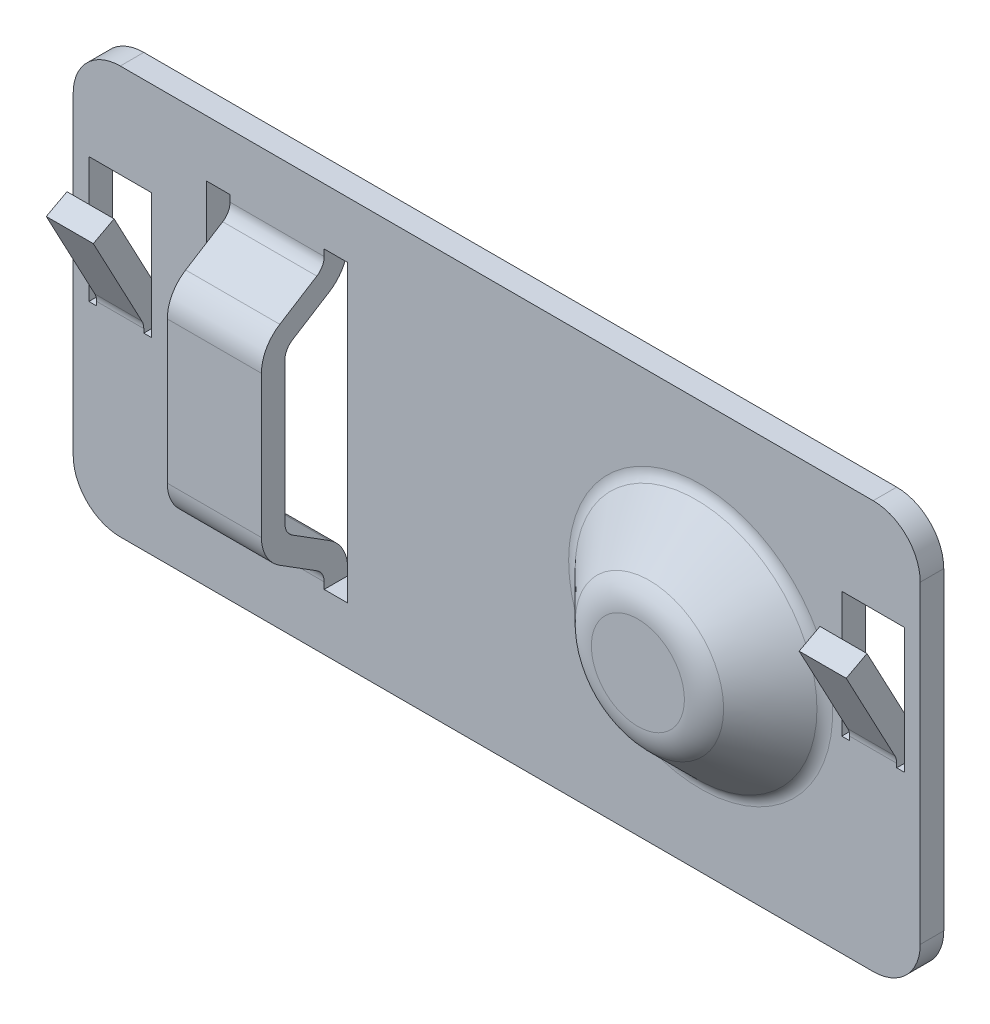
ISO-10303-21;
HEADER;
FILE_DESCRIPTION(('STEP AP214'),'2;1');
FILE_NAME('part.step','',(''),(''),'','','');
FILE_SCHEMA(('AUTOMOTIVE_DESIGN { 1 0 10303 214 1 1 1 1 }'));
ENDSEC;
DATA;
#1=APPLICATION_CONTEXT('core data for automotive mechanical design processes');
#2=APPLICATION_PROTOCOL_DEFINITION('international standard','automotive_design',2000,#1);
#3=PRODUCT_CONTEXT('',#1,'mechanical');
#4=PRODUCT('Part','Part','',(#3));
#5=PRODUCT_RELATED_PRODUCT_CATEGORY('part','',(#4));
#6=PRODUCT_DEFINITION_FORMATION('','',#4);
#7=PRODUCT_DEFINITION_CONTEXT('part definition',#1,'design');
#8=PRODUCT_DEFINITION('design','',#6,#7);
#9=PRODUCT_DEFINITION_SHAPE('','',#8);
#10=(LENGTH_UNIT() NAMED_UNIT(*) SI_UNIT(.MILLI.,.METRE.));
#11=(NAMED_UNIT(*) PLANE_ANGLE_UNIT() SI_UNIT($,.RADIAN.));
#12=(NAMED_UNIT(*) SI_UNIT($,.STERADIAN.) SOLID_ANGLE_UNIT());
#13=UNCERTAINTY_MEASURE_WITH_UNIT(LENGTH_MEASURE(1.E-05),#10,'distance_accuracy_value','');
#14=(GEOMETRIC_REPRESENTATION_CONTEXT(3) GLOBAL_UNCERTAINTY_ASSIGNED_CONTEXT((#13)) GLOBAL_UNIT_ASSIGNED_CONTEXT((#10,
#11,#12)) REPRESENTATION_CONTEXT('',''));
#15=CARTESIAN_POINT('',(0.,0.,0.));
#16=DIRECTION('',(0.,0.,1.));
#17=DIRECTION('',(1.,0.,0.));
#18=AXIS2_PLACEMENT_3D('',#15,#16,#17);
#19=CARTESIAN_POINT('',(-19.5,-0.5,0.75));
#20=DIRECTION('',(0.,1.,0.));
#21=DIRECTION('',(0.,0.,1.));
#22=AXIS2_PLACEMENT_3D('',#19,#20,#21);
#23=PLANE('',#22);
#24=DIRECTION('',(1.,0.,0.));
#25=VECTOR('',#24,1.);
#26=CARTESIAN_POINT('',(-19.5,-0.5,0.));
#27=LINE('',#26,#25);
#28=CARTESIAN_POINT('',(-17.75,-0.5,0.));
#29=VERTEX_POINT('',#28);
#30=CARTESIAN_POINT('',(-17.5,-0.5,0.));
#31=VERTEX_POINT('',#30);
#32=EDGE_CURVE('E598',#29,#31,#27,.T.);
#33=ORIENTED_EDGE('',*,*,#32,.F.);
#34=DIRECTION('',(0.,0.,-1.));
#35=VECTOR('',#34,1.);
#36=CARTESIAN_POINT('',(-17.75,-0.500000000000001,0.75));
#37=LINE('',#36,#35);
#38=CARTESIAN_POINT('',(-17.75,-0.5,0.75));
#39=VERTEX_POINT('',#38);
#40=EDGE_CURVE('E427',#39,#29,#37,.T.);
#41=ORIENTED_EDGE('',*,*,#40,.F.);
#42=DIRECTION('',(1.,0.,0.));
#43=VECTOR('',#42,1.);
#44=CARTESIAN_POINT('',(-19.5,-0.5,0.75));
#45=LINE('',#44,#43);
#46=CARTESIAN_POINT('',(-17.5,-0.5,0.75));
#47=VERTEX_POINT('',#46);
#48=EDGE_CURVE('E610',#39,#47,#45,.T.);
#49=ORIENTED_EDGE('',*,*,#48,.T.);
#50=DIRECTION('',(0.,0.,-1.));
#51=VECTOR('',#50,1.);
#52=CARTESIAN_POINT('',(-17.5,-0.5,0.75));
#53=LINE('',#52,#51);
#54=EDGE_CURVE('E624',#47,#31,#53,.T.);
#55=ORIENTED_EDGE('',*,*,#54,.T.);
#56=EDGE_LOOP('',(#33,#41,#49,#55));
#57=FACE_BOUND('',#56,.T.);
#58=ADVANCED_FACE('F32',(#57),#23,.T.);
#59=CARTESIAN_POINT('',(4.5,-0.5,0.75));
#60=DIRECTION('',(0.,1.,0.));
#61=DIRECTION('',(0.,0.,1.));
#62=AXIS2_PLACEMENT_3D('',#59,#60,#61);
#63=PLANE('',#62);
#64=DIRECTION('',(1.,0.,0.));
#65=VECTOR('',#64,1.);
#66=CARTESIAN_POINT('',(4.5,-0.5,0.));
#67=LINE('',#66,#65);
#68=CARTESIAN_POINT('',(6.25,-0.5,0.));
#69=VERTEX_POINT('',#68);
#70=CARTESIAN_POINT('',(6.5,-0.5,0.));
#71=VERTEX_POINT('',#70);
#72=EDGE_CURVE('E525',#69,#71,#67,.T.);
#73=ORIENTED_EDGE('',*,*,#72,.F.);
#74=DIRECTION('',(0.,0.,-1.));
#75=VECTOR('',#74,1.);
#76=CARTESIAN_POINT('',(6.25,-0.500000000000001,0.75));
#77=LINE('',#76,#75);
#78=CARTESIAN_POINT('',(6.25,-0.5,0.75));
#79=VERTEX_POINT('',#78);
#80=EDGE_CURVE('E456',#79,#69,#77,.T.);
#81=ORIENTED_EDGE('',*,*,#80,.F.);
#82=DIRECTION('',(1.,0.,0.));
#83=VECTOR('',#82,1.);
#84=CARTESIAN_POINT('',(4.5,-0.5,0.75));
#85=LINE('',#84,#83);
#86=CARTESIAN_POINT('',(6.5,-0.5,0.75));
#87=VERTEX_POINT('',#86);
#88=EDGE_CURVE('E537',#79,#87,#85,.T.);
#89=ORIENTED_EDGE('',*,*,#88,.T.);
#90=DIRECTION('',(0.,0.,-1.));
#91=VECTOR('',#90,1.);
#92=CARTESIAN_POINT('',(6.5,-0.5,0.75));
#93=LINE('',#92,#91);
#94=EDGE_CURVE('E551',#87,#71,#93,.T.);
#95=ORIENTED_EDGE('',*,*,#94,.T.);
#96=EDGE_LOOP('',(#73,#81,#89,#95));
#97=FACE_BOUND('',#96,.T.);
#98=ADVANCED_FACE('F849',(#97),#63,.T.);
#99=CARTESIAN_POINT('',(-15.75,-4.7,0.75));
#100=DIRECTION('',(0.,1.,0.));
#101=DIRECTION('',(-1.,0.,0.));
#102=AXIS2_PLACEMENT_3D('',#99,#100,#101);
#103=PLANE('',#102);
#104=DIRECTION('',(1.,0.,0.));
#105=VECTOR('',#104,1.);
#106=CARTESIAN_POINT('',(-15.75,-4.7,0.75));
#107=LINE('',#106,#105);
#108=CARTESIAN_POINT('',(-15.75,-4.7,0.75));
#109=VERTEX_POINT('',#108);
#110=CARTESIAN_POINT('',(-15.,-4.7,0.75));
#111=VERTEX_POINT('',#110);
#112=EDGE_CURVE('E574',#109,#111,#107,.T.);
#113=ORIENTED_EDGE('',*,*,#112,.T.);
#114=DIRECTION('',(0.,0.,-1.));
#115=VECTOR('',#114,1.);
#116=CARTESIAN_POINT('',(-15.,-4.7,0.));
#117=LINE('',#116,#115);
#118=CARTESIAN_POINT('',(-15.,-4.7,0.));
#119=VERTEX_POINT('',#118);
#120=EDGE_CURVE('E467',#111,#119,#117,.T.);
#121=ORIENTED_EDGE('',*,*,#120,.T.);
#122=DIRECTION('',(1.,0.,0.));
#123=VECTOR('',#122,1.);
#124=CARTESIAN_POINT('',(-15.75,-4.7,0.));
#125=LINE('',#124,#123);
#126=CARTESIAN_POINT('',(-15.75,-4.7,0.));
#127=VERTEX_POINT('',#126);
#128=EDGE_CURVE('E561',#127,#119,#125,.T.);
#129=ORIENTED_EDGE('',*,*,#128,.F.);
#130=DIRECTION('',(0.,0.,-1.));
#131=VECTOR('',#130,1.);
#132=CARTESIAN_POINT('',(-15.75,-4.7,0.75));
#133=LINE('',#132,#131);
#134=EDGE_CURVE('E592',#109,#127,#133,.T.);
#135=ORIENTED_EDGE('',*,*,#134,.F.);
#136=EDGE_LOOP('',(#113,#121,#129,#135));
#137=FACE_BOUND('',#136,.T.);
#138=ADVANCED_FACE('F856',(#137),#103,.T.);
#139=CARTESIAN_POINT('',(-15.75,4.7,0.75));
#140=DIRECTION('',(0.,-1.,0.));
#141=DIRECTION('',(0.,0.,-1.));
#142=AXIS2_PLACEMENT_3D('',#139,#140,#141);
#143=PLANE('',#142);
#144=DIRECTION('',(-1.,0.,0.));
#145=VECTOR('',#144,1.);
#146=CARTESIAN_POINT('',(-15.75,4.7,0.));
#147=LINE('',#146,#145);
#148=CARTESIAN_POINT('',(-15.,4.7,0.));
#149=VERTEX_POINT('',#148);
#150=CARTESIAN_POINT('',(-15.75,4.7,0.));
#151=VERTEX_POINT('',#150);
#152=EDGE_CURVE('E567',#149,#151,#147,.T.);
#153=ORIENTED_EDGE('',*,*,#152,.F.);
#154=DIRECTION('',(0.,0.,1.));
#155=VECTOR('',#154,1.);
#156=CARTESIAN_POINT('',(-15.,4.7,0.75));
#157=LINE('',#156,#155);
#158=CARTESIAN_POINT('',(-15.,4.7,0.75));
#159=VERTEX_POINT('',#158);
#160=EDGE_CURVE('E712',#149,#159,#157,.T.);
#161=ORIENTED_EDGE('',*,*,#160,.T.);
#162=DIRECTION('',(-1.,0.,0.));
#163=VECTOR('',#162,1.);
#164=CARTESIAN_POINT('',(-15.75,4.7,0.75));
#165=LINE('',#164,#163);
#166=CARTESIAN_POINT('',(-15.75,4.7,0.75));
#167=VERTEX_POINT('',#166);
#168=EDGE_CURVE('E580',#159,#167,#165,.T.);
#169=ORIENTED_EDGE('',*,*,#168,.T.);
#170=DIRECTION('',(0.,0.,-1.));
#171=VECTOR('',#170,1.);
#172=CARTESIAN_POINT('',(-15.75,4.7,0.75));
#173=LINE('',#172,#171);
#174=EDGE_CURVE('E584',#167,#151,#173,.T.);
#175=ORIENTED_EDGE('',*,*,#174,.T.);
#176=EDGE_LOOP('',(#153,#161,#169,#175));
#177=FACE_BOUND('',#176,.T.);
#178=ADVANCED_FACE('F955',(#177),#143,.T.);
#179=CARTESIAN_POINT('',(5.5,5.,0.75));
#180=DIRECTION('',(0.,0.,-1.));
#181=DIRECTION('',(-1.,0.,0.));
#182=AXIS2_PLACEMENT_3D('',#179,#180,#181);
#183=PLANE('',#182);
#184=DIRECTION('',(0.,-1.,0.));
#185=VECTOR('',#184,1.);
#186=CARTESIAN_POINT('',(-12.,-4.7,0.75));
#187=LINE('',#186,#185);
#188=CARTESIAN_POINT('',(-12.,-4.49103368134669,0.75));
#189=VERTEX_POINT('',#188);
#190=CARTESIAN_POINT('',(-12.,-4.7,0.75));
#191=VERTEX_POINT('',#190);
#192=EDGE_CURVE('E494',#189,#191,#187,.T.);
#193=ORIENTED_EDGE('',*,*,#192,.F.);
#194=DIRECTION('',(-1.,0.,0.));
#195=VECTOR('',#194,1.);
#196=CARTESIAN_POINT('',(-15.,-4.49103368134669,0.75));
#197=LINE('',#196,#195);
#198=CARTESIAN_POINT('',(-15.,-4.49103368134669,0.75));
#199=VERTEX_POINT('',#198);
#200=EDGE_CURVE('E769',#189,#199,#197,.T.);
#201=ORIENTED_EDGE('',*,*,#200,.T.);
#202=DIRECTION('',(0.,-1.,0.));
#203=VECTOR('',#202,1.);
#204=CARTESIAN_POINT('',(-15.,-4.7,0.75));
#205=LINE('',#204,#203);
#206=EDGE_CURVE('E465',#199,#111,#205,.T.);
#207=ORIENTED_EDGE('',*,*,#206,.T.);
#208=ORIENTED_EDGE('',*,*,#112,.F.);
#209=DIRECTION('',(0.,-1.,0.));
#210=VECTOR('',#209,1.);
#211=CARTESIAN_POINT('',(-15.75,4.7,0.75));
#212=LINE('',#211,#210);
#213=EDGE_CURVE('E571',#167,#109,#212,.T.);
#214=ORIENTED_EDGE('',*,*,#213,.F.);
#215=ORIENTED_EDGE('',*,*,#168,.F.);
#216=DIRECTION('',(0.,-1.,0.));
#217=VECTOR('',#216,1.);
#218=CARTESIAN_POINT('',(-15.,4.21462020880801,0.749999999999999));
#219=LINE('',#218,#217);
#220=CARTESIAN_POINT('',(-15.,4.49103368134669,0.75));
#221=VERTEX_POINT('',#220);
#222=EDGE_CURVE('E483',#159,#221,#219,.T.);
#223=ORIENTED_EDGE('',*,*,#222,.T.);
#224=DIRECTION('',(-1.,0.,0.));
#225=VECTOR('',#224,1.);
#226=CARTESIAN_POINT('',(-12.,4.49103368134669,0.75));
#227=LINE('',#226,#225);
#228=CARTESIAN_POINT('',(-12.,4.49103368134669,0.75));
#229=VERTEX_POINT('',#228);
#230=EDGE_CURVE('E767',#221,#229,#227,.F.);
#231=ORIENTED_EDGE('',*,*,#230,.T.);
#232=DIRECTION('',(0.,-1.,0.));
#233=VECTOR('',#232,1.);
#234=CARTESIAN_POINT('',(-12.,4.21462020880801,0.749999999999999));
#235=LINE('',#234,#233);
#236=CARTESIAN_POINT('',(-12.,4.7,0.75));
#237=VERTEX_POINT('',#236);
#238=EDGE_CURVE('E511',#237,#229,#235,.T.);
#239=ORIENTED_EDGE('',*,*,#238,.F.);
#240=CARTESIAN_POINT('',(-11.25,4.7,0.75));
#241=VERTEX_POINT('',#240);
#242=EDGE_CURVE('E581',#241,#237,#165,.T.);
#243=ORIENTED_EDGE('',*,*,#242,.F.);
#244=DIRECTION('',(0.,1.,0.));
#245=VECTOR('',#244,1.);
#246=CARTESIAN_POINT('',(-11.25,4.7,0.75));
#247=LINE('',#246,#245);
#248=CARTESIAN_POINT('',(-11.25,-4.7,0.75));
#249=VERTEX_POINT('',#248);
#250=EDGE_CURVE('E577',#249,#241,#247,.T.);
#251=ORIENTED_EDGE('',*,*,#250,.F.);
#252=EDGE_CURVE('E573',#191,#249,#107,.T.);
#253=ORIENTED_EDGE('',*,*,#252,.F.);
#254=EDGE_LOOP('',(#193,#201,#207,#208,#214,#215,#223,#231,#239,#243,#251,#253));
#255=FACE_BOUND('',#254,.T.);
#256=CARTESIAN_POINT('',(0.,0.,0.75));
#257=DIRECTION('',(0.,0.,-1.));
#258=DIRECTION('',(-1.,0.,0.));
#259=AXIS2_PLACEMENT_3D('',#256,#257,#258);
#260=CIRCLE('',#259,4.20776695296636);
#261=CARTESIAN_POINT('',(-4.20776695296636,0.,0.75));
#262=VERTEX_POINT('',#261);
#263=EDGE_CURVE('E700',#262,#262,#260,.T.);
#264=ORIENTED_EDGE('',*,*,#263,.T.);
#265=EDGE_LOOP('',(#264));
#266=FACE_BOUND('',#265,.T.);
#267=CARTESIAN_POINT('',(5.5,5.,0.75));
#268=DIRECTION('',(0.,0.,1.));
#269=DIRECTION('',(-1.,0.,0.));
#270=AXIS2_PLACEMENT_3D('',#267,#268,#269);
#271=CIRCLE('',#270,1.5);
#272=CARTESIAN_POINT('',(7.,4.99999999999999,0.75));
#273=VERTEX_POINT('',#272);
#274=CARTESIAN_POINT('',(5.49999999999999,6.5,0.75));
#275=VERTEX_POINT('',#274);
#276=EDGE_CURVE('E647',#273,#275,#271,.T.);
#277=ORIENTED_EDGE('',*,*,#276,.T.);
#278=DIRECTION('',(-1.,0.,0.));
#279=VECTOR('',#278,1.);
#280=CARTESIAN_POINT('',(-18.5,6.5,0.75));
#281=LINE('',#280,#279);
#282=CARTESIAN_POINT('',(-18.5,6.5,0.75));
#283=VERTEX_POINT('',#282);
#284=EDGE_CURVE('E650',#275,#283,#281,.T.);
#285=ORIENTED_EDGE('',*,*,#284,.T.);
#286=CARTESIAN_POINT('',(-18.5,5.,0.75));
#287=DIRECTION('',(0.,0.,1.));
#288=DIRECTION('',(-1.,0.,0.));
#289=AXIS2_PLACEMENT_3D('',#286,#287,#288);
#290=CIRCLE('',#289,1.5);
#291=CARTESIAN_POINT('',(-20.,4.99999999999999,0.75));
#292=VERTEX_POINT('',#291);
#293=EDGE_CURVE('E652',#283,#292,#290,.T.);
#294=ORIENTED_EDGE('',*,*,#293,.T.);
#295=DIRECTION('',(0.,-1.,0.));
#296=VECTOR('',#295,1.);
#297=CARTESIAN_POINT('',(-20.,-4.99999999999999,0.75));
#298=LINE('',#297,#296);
#299=CARTESIAN_POINT('',(-20.,-4.99999999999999,0.75));
#300=VERTEX_POINT('',#299);
#301=EDGE_CURVE('E654',#292,#300,#298,.T.);
#302=ORIENTED_EDGE('',*,*,#301,.T.);
#303=CARTESIAN_POINT('',(-18.5,-5.,0.75));
#304=DIRECTION('',(0.,0.,1.));
#305=DIRECTION('',(-1.,0.,0.));
#306=AXIS2_PLACEMENT_3D('',#303,#304,#305);
#307=CIRCLE('',#306,1.5);
#308=CARTESIAN_POINT('',(-18.5,-6.5,0.75));
#309=VERTEX_POINT('',#308);
#310=EDGE_CURVE('E656',#300,#309,#307,.T.);
#311=ORIENTED_EDGE('',*,*,#310,.T.);
#312=DIRECTION('',(1.,0.,0.));
#313=VECTOR('',#312,1.);
#314=CARTESIAN_POINT('',(-18.5,-6.5,0.75));
#315=LINE('',#314,#313);
#316=CARTESIAN_POINT('',(5.49999999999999,-6.5,0.75));
#317=VERTEX_POINT('',#316);
#318=EDGE_CURVE('E658',#309,#317,#315,.T.);
#319=ORIENTED_EDGE('',*,*,#318,.T.);
#320=CARTESIAN_POINT('',(5.5,-5.,0.75));
#321=DIRECTION('',(0.,0.,1.));
#322=DIRECTION('',(1.,0.,0.));
#323=AXIS2_PLACEMENT_3D('',#320,#321,#322);
#324=CIRCLE('',#323,1.5);
#325=CARTESIAN_POINT('',(7.,-4.99999999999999,0.75));
#326=VERTEX_POINT('',#325);
#327=EDGE_CURVE('E660',#317,#326,#324,.T.);
#328=ORIENTED_EDGE('',*,*,#327,.T.);
#329=DIRECTION('',(0.,1.,0.));
#330=VECTOR('',#329,1.);
#331=CARTESIAN_POINT('',(7.,-4.99999999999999,0.75));
#332=LINE('',#331,#330);
#333=EDGE_CURVE('E662',#326,#273,#332,.T.);
#334=ORIENTED_EDGE('',*,*,#333,.T.);
#335=EDGE_LOOP('',(#277,#285,#294,#302,#311,#319,#328,#334));
#336=FACE_BOUND('',#335,.T.);
#337=DIRECTION('',(0.,-1.,0.));
#338=VECTOR('',#337,1.);
#339=CARTESIAN_POINT('',(-17.75,-0.250000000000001,0.75));
#340=LINE('',#339,#338);
#341=CARTESIAN_POINT('',(-17.75,-0.37466400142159,0.75));
#342=VERTEX_POINT('',#341);
#343=EDGE_CURVE('E425',#342,#39,#340,.T.);
#344=ORIENTED_EDGE('',*,*,#343,.F.);
#345=DIRECTION('',(-1.,0.,0.));
#346=VECTOR('',#345,1.);
#347=CARTESIAN_POINT('',(-19.25,-0.37466400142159,0.75));
#348=LINE('',#347,#346);
#349=CARTESIAN_POINT('',(-19.25,-0.37466400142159,0.75));
#350=VERTEX_POINT('',#349);
#351=EDGE_CURVE('E811',#342,#350,#348,.T.);
#352=ORIENTED_EDGE('',*,*,#351,.T.);
#353=DIRECTION('',(0.,-1.,0.));
#354=VECTOR('',#353,1.);
#355=CARTESIAN_POINT('',(-19.25,-0.250000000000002,0.75));
#356=LINE('',#355,#354);
#357=CARTESIAN_POINT('',(-19.25,-0.500000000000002,0.75));
#358=VERTEX_POINT('',#357);
#359=EDGE_CURVE('E410',#350,#358,#356,.T.);
#360=ORIENTED_EDGE('',*,*,#359,.T.);
#361=CARTESIAN_POINT('',(-19.5,-0.5,0.75));
#362=VERTEX_POINT('',#361);
#363=EDGE_CURVE('E611',#362,#358,#45,.T.);
#364=ORIENTED_EDGE('',*,*,#363,.F.);
#365=DIRECTION('',(0.,-1.,0.));
#366=VECTOR('',#365,1.);
#367=CARTESIAN_POINT('',(-19.5,3.5,0.75));
#368=LINE('',#367,#366);
#369=CARTESIAN_POINT('',(-19.5,3.5,0.75));
#370=VERTEX_POINT('',#369);
#371=EDGE_CURVE('E608',#370,#362,#368,.T.);
#372=ORIENTED_EDGE('',*,*,#371,.F.);
#373=DIRECTION('',(-1.,0.,0.));
#374=VECTOR('',#373,1.);
#375=CARTESIAN_POINT('',(-19.5,3.5,0.75));
#376=LINE('',#375,#374);
#377=CARTESIAN_POINT('',(-17.5,3.5,0.75));
#378=VERTEX_POINT('',#377);
#379=EDGE_CURVE('E617',#378,#370,#376,.T.);
#380=ORIENTED_EDGE('',*,*,#379,.F.);
#381=DIRECTION('',(0.,1.,0.));
#382=VECTOR('',#381,1.);
#383=CARTESIAN_POINT('',(-17.5,3.5,0.75));
#384=LINE('',#383,#382);
#385=EDGE_CURVE('E614',#47,#378,#384,.T.);
#386=ORIENTED_EDGE('',*,*,#385,.F.);
#387=ORIENTED_EDGE('',*,*,#48,.F.);
#388=EDGE_LOOP('',(#344,#352,#360,#364,#372,#380,#386,#387));
#389=FACE_BOUND('',#388,.T.);
#390=DIRECTION('',(0.,-1.,0.));
#391=VECTOR('',#390,1.);
#392=CARTESIAN_POINT('',(6.25,-0.25,0.75));
#393=LINE('',#392,#391);
#394=CARTESIAN_POINT('',(6.25,-0.374664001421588,0.75));
#395=VERTEX_POINT('',#394);
#396=EDGE_CURVE('E454',#395,#79,#393,.T.);
#397=ORIENTED_EDGE('',*,*,#396,.F.);
#398=DIRECTION('',(-1.,0.,0.));
#399=VECTOR('',#398,1.);
#400=CARTESIAN_POINT('',(4.75,-0.374664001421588,0.75));
#401=LINE('',#400,#399);
#402=CARTESIAN_POINT('',(4.75,-0.374664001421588,0.75));
#403=VERTEX_POINT('',#402);
#404=EDGE_CURVE('E793',#395,#403,#401,.T.);
#405=ORIENTED_EDGE('',*,*,#404,.T.);
#406=DIRECTION('',(0.,-1.,0.));
#407=VECTOR('',#406,1.);
#408=CARTESIAN_POINT('',(4.75,-0.250000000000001,0.75));
#409=LINE('',#408,#407);
#410=CARTESIAN_POINT('',(4.75,-0.500000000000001,0.75));
#411=VERTEX_POINT('',#410);
#412=EDGE_CURVE('E440',#403,#411,#409,.T.);
#413=ORIENTED_EDGE('',*,*,#412,.T.);
#414=CARTESIAN_POINT('',(4.5,-0.5,0.75));
#415=VERTEX_POINT('',#414);
#416=EDGE_CURVE('E538',#415,#411,#85,.T.);
#417=ORIENTED_EDGE('',*,*,#416,.F.);
#418=DIRECTION('',(0.,-1.,0.));
#419=VECTOR('',#418,1.);
#420=CARTESIAN_POINT('',(4.5,3.5,0.75));
#421=LINE('',#420,#419);
#422=CARTESIAN_POINT('',(4.5,3.5,0.75));
#423=VERTEX_POINT('',#422);
#424=EDGE_CURVE('E535',#423,#415,#421,.T.);
#425=ORIENTED_EDGE('',*,*,#424,.F.);
#426=DIRECTION('',(-1.,0.,0.));
#427=VECTOR('',#426,1.);
#428=CARTESIAN_POINT('',(4.5,3.5,0.75));
#429=LINE('',#428,#427);
#430=CARTESIAN_POINT('',(6.5,3.5,0.75));
#431=VERTEX_POINT('',#430);
#432=EDGE_CURVE('E544',#431,#423,#429,.T.);
#433=ORIENTED_EDGE('',*,*,#432,.F.);
#434=DIRECTION('',(0.,1.,0.));
#435=VECTOR('',#434,1.);
#436=CARTESIAN_POINT('',(6.5,3.5,0.75));
#437=LINE('',#436,#435);
#438=EDGE_CURVE('E541',#87,#431,#437,.T.);
#439=ORIENTED_EDGE('',*,*,#438,.F.);
#440=ORIENTED_EDGE('',*,*,#88,.F.);
#441=EDGE_LOOP('',(#397,#405,#413,#417,#425,#433,#439,#440));
#442=FACE_BOUND('',#441,.T.);
#443=ADVANCED_FACE('F832',(#255,#266,#336,#389,#442),#183,.F.);
#444=CARTESIAN_POINT('',(5.5,5.,0.));
#445=DIRECTION('',(0.,0.,-1.));
#446=DIRECTION('',(-1.,0.,0.));
#447=AXIS2_PLACEMENT_3D('',#444,#445,#446);
#448=PLANE('',#447);
#449=DIRECTION('',(0.,1.,0.));
#450=VECTOR('',#449,1.);
#451=CARTESIAN_POINT('',(-12.,4.75657800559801,0.));
#452=LINE('',#451,#450);
#453=CARTESIAN_POINT('',(-12.,4.49103368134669,0.));
#454=VERTEX_POINT('',#453);
#455=CARTESIAN_POINT('',(-12.,4.7,0.));
#456=VERTEX_POINT('',#455);
#457=EDGE_CURVE('E509',#454,#456,#452,.T.);
#458=ORIENTED_EDGE('',*,*,#457,.F.);
#459=DIRECTION('',(-1.,0.,0.));
#460=VECTOR('',#459,1.);
#461=CARTESIAN_POINT('',(-15.,4.49103368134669,0.));
#462=LINE('',#461,#460);
#463=CARTESIAN_POINT('',(-15.,4.49103368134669,0.));
#464=VERTEX_POINT('',#463);
#465=EDGE_CURVE('E748',#454,#464,#462,.T.);
#466=ORIENTED_EDGE('',*,*,#465,.T.);
#467=DIRECTION('',(0.,1.,0.));
#468=VECTOR('',#467,1.);
#469=CARTESIAN_POINT('',(-15.,4.75657800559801,0.));
#470=LINE('',#469,#468);
#471=EDGE_CURVE('E481',#464,#149,#470,.T.);
#472=ORIENTED_EDGE('',*,*,#471,.T.);
#473=ORIENTED_EDGE('',*,*,#152,.T.);
#474=DIRECTION('',(0.,-1.,0.));
#475=VECTOR('',#474,1.);
#476=CARTESIAN_POINT('',(-15.75,4.7,0.));
#477=LINE('',#476,#475);
#478=EDGE_CURVE('E557',#151,#127,#477,.T.);
#479=ORIENTED_EDGE('',*,*,#478,.T.);
#480=ORIENTED_EDGE('',*,*,#128,.T.);
#481=DIRECTION('',(0.,1.,0.));
#482=VECTOR('',#481,1.);
#483=CARTESIAN_POINT('',(-15.,-3.8,0.));
#484=LINE('',#483,#482);
#485=CARTESIAN_POINT('',(-15.,-4.49103368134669,0.));
#486=VERTEX_POINT('',#485);
#487=EDGE_CURVE('E470',#119,#486,#484,.T.);
#488=ORIENTED_EDGE('',*,*,#487,.T.);
#489=DIRECTION('',(-1.,0.,0.));
#490=VECTOR('',#489,1.);
#491=CARTESIAN_POINT('',(-12.,-4.49103368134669,0.));
#492=LINE('',#491,#490);
#493=CARTESIAN_POINT('',(-12.,-4.49103368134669,0.));
#494=VERTEX_POINT('',#493);
#495=EDGE_CURVE('E746',#486,#494,#492,.F.);
#496=ORIENTED_EDGE('',*,*,#495,.T.);
#497=DIRECTION('',(0.,1.,0.));
#498=VECTOR('',#497,1.);
#499=CARTESIAN_POINT('',(-12.,-3.8,0.));
#500=LINE('',#499,#498);
#501=CARTESIAN_POINT('',(-12.,-4.7,0.));
#502=VERTEX_POINT('',#501);
#503=EDGE_CURVE('E498',#502,#494,#500,.T.);
#504=ORIENTED_EDGE('',*,*,#503,.F.);
#505=CARTESIAN_POINT('',(-11.25,-4.7,0.));
#506=VERTEX_POINT('',#505);
#507=EDGE_CURVE('E560',#502,#506,#125,.T.);
#508=ORIENTED_EDGE('',*,*,#507,.T.);
#509=DIRECTION('',(0.,1.,0.));
#510=VECTOR('',#509,1.);
#511=CARTESIAN_POINT('',(-11.25,4.7,0.));
#512=LINE('',#511,#510);
#513=CARTESIAN_POINT('',(-11.25,4.7,0.));
#514=VERTEX_POINT('',#513);
#515=EDGE_CURVE('E564',#506,#514,#512,.T.);
#516=ORIENTED_EDGE('',*,*,#515,.T.);
#517=EDGE_CURVE('E568',#514,#456,#147,.T.);
#518=ORIENTED_EDGE('',*,*,#517,.T.);
#519=EDGE_LOOP('',(#458,#466,#472,#473,#479,#480,#488,#496,#504,#508,#516,#518));
#520=FACE_BOUND('',#519,.T.);
#521=CARTESIAN_POINT('',(0.,0.,0.));
#522=DIRECTION('',(0.,0.,-1.));
#523=DIRECTION('',(-1.,0.,0.));
#524=AXIS2_PLACEMENT_3D('',#521,#522,#523);
#525=CIRCLE('',#524,4.20776695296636);
#526=CARTESIAN_POINT('',(-4.20776695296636,0.,0.));
#527=VERTEX_POINT('',#526);
#528=EDGE_CURVE('E691',#527,#527,#525,.F.);
#529=ORIENTED_EDGE('',*,*,#528,.T.);
#530=EDGE_LOOP('',(#529));
#531=FACE_BOUND('',#530,.T.);
#532=CARTESIAN_POINT('',(5.5,5.,0.));
#533=DIRECTION('',(0.,0.,1.));
#534=DIRECTION('',(-1.,0.,0.));
#535=AXIS2_PLACEMENT_3D('',#532,#533,#534);
#536=CIRCLE('',#535,1.5);
#537=CARTESIAN_POINT('',(7.,4.99999999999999,0.));
#538=VERTEX_POINT('',#537);
#539=CARTESIAN_POINT('',(5.49999999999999,6.5,0.));
#540=VERTEX_POINT('',#539);
#541=EDGE_CURVE('E630',#538,#540,#536,.T.);
#542=ORIENTED_EDGE('',*,*,#541,.F.);
#543=DIRECTION('',(0.,1.,0.));
#544=VECTOR('',#543,1.);
#545=CARTESIAN_POINT('',(7.,-4.99999999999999,0.));
#546=LINE('',#545,#544);
#547=CARTESIAN_POINT('',(7.,-4.99999999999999,0.));
#548=VERTEX_POINT('',#547);
#549=EDGE_CURVE('E645',#548,#538,#546,.T.);
#550=ORIENTED_EDGE('',*,*,#549,.F.);
#551=CARTESIAN_POINT('',(5.5,-5.,0.));
#552=DIRECTION('',(0.,0.,1.));
#553=DIRECTION('',(1.,0.,0.));
#554=AXIS2_PLACEMENT_3D('',#551,#552,#553);
#555=CIRCLE('',#554,1.5);
#556=CARTESIAN_POINT('',(5.49999999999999,-6.5,0.));
#557=VERTEX_POINT('',#556);
#558=EDGE_CURVE('E643',#557,#548,#555,.T.);
#559=ORIENTED_EDGE('',*,*,#558,.F.);
#560=DIRECTION('',(1.,0.,0.));
#561=VECTOR('',#560,1.);
#562=CARTESIAN_POINT('',(-18.5,-6.5,0.));
#563=LINE('',#562,#561);
#564=CARTESIAN_POINT('',(-18.5,-6.5,0.));
#565=VERTEX_POINT('',#564);
#566=EDGE_CURVE('E641',#565,#557,#563,.T.);
#567=ORIENTED_EDGE('',*,*,#566,.F.);
#568=CARTESIAN_POINT('',(-18.5,-5.,0.));
#569=DIRECTION('',(0.,0.,1.));
#570=DIRECTION('',(-1.,0.,0.));
#571=AXIS2_PLACEMENT_3D('',#568,#569,#570);
#572=CIRCLE('',#571,1.5);
#573=CARTESIAN_POINT('',(-20.,-4.99999999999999,0.));
#574=VERTEX_POINT('',#573);
#575=EDGE_CURVE('E639',#574,#565,#572,.T.);
#576=ORIENTED_EDGE('',*,*,#575,.F.);
#577=DIRECTION('',(0.,-1.,0.));
#578=VECTOR('',#577,1.);
#579=CARTESIAN_POINT('',(-20.,-4.99999999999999,0.));
#580=LINE('',#579,#578);
#581=CARTESIAN_POINT('',(-20.,4.99999999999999,0.));
#582=VERTEX_POINT('',#581);
#583=EDGE_CURVE('E637',#582,#574,#580,.T.);
#584=ORIENTED_EDGE('',*,*,#583,.F.);
#585=CARTESIAN_POINT('',(-18.5,5.,0.));
#586=DIRECTION('',(0.,0.,1.));
#587=DIRECTION('',(-1.,0.,0.));
#588=AXIS2_PLACEMENT_3D('',#585,#586,#587);
#589=CIRCLE('',#588,1.5);
#590=CARTESIAN_POINT('',(-18.5,6.5,0.));
#591=VERTEX_POINT('',#590);
#592=EDGE_CURVE('E635',#591,#582,#589,.T.);
#593=ORIENTED_EDGE('',*,*,#592,.F.);
#594=DIRECTION('',(-1.,0.,0.));
#595=VECTOR('',#594,1.);
#596=CARTESIAN_POINT('',(-18.5,6.5,0.));
#597=LINE('',#596,#595);
#598=EDGE_CURVE('E633',#540,#591,#597,.T.);
#599=ORIENTED_EDGE('',*,*,#598,.F.);
#600=EDGE_LOOP('',(#542,#550,#559,#567,#576,#584,#593,#599));
#601=FACE_BOUND('',#600,.T.);
#602=DIRECTION('',(0.,1.,0.));
#603=VECTOR('',#602,1.);
#604=CARTESIAN_POINT('',(-19.25,-0.500000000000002,0.));
#605=LINE('',#604,#603);
#606=CARTESIAN_POINT('',(-19.25,-0.5,0.));
#607=VERTEX_POINT('',#606);
#608=CARTESIAN_POINT('',(-19.25,-0.374664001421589,0.));
#609=VERTEX_POINT('',#608);
#610=EDGE_CURVE('E395',#607,#609,#605,.T.);
#611=ORIENTED_EDGE('',*,*,#610,.T.);
#612=DIRECTION('',(-1.,0.,0.));
#613=VECTOR('',#612,1.);
#614=CARTESIAN_POINT('',(-17.75,-0.374664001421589,0.));
#615=LINE('',#614,#613);
#616=CARTESIAN_POINT('',(-17.75,-0.374664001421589,0.));
#617=VERTEX_POINT('',#616);
#618=EDGE_CURVE('E40',#609,#617,#615,.F.);
#619=ORIENTED_EDGE('',*,*,#618,.T.);
#620=DIRECTION('',(0.,1.,0.));
#621=VECTOR('',#620,1.);
#622=CARTESIAN_POINT('',(-17.75,-0.500000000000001,0.));
#623=LINE('',#622,#621);
#624=EDGE_CURVE('E417',#29,#617,#623,.T.);
#625=ORIENTED_EDGE('',*,*,#624,.F.);
#626=ORIENTED_EDGE('',*,*,#32,.T.);
#627=DIRECTION('',(0.,1.,0.));
#628=VECTOR('',#627,1.);
#629=CARTESIAN_POINT('',(-17.5,3.5,0.));
#630=LINE('',#629,#628);
#631=CARTESIAN_POINT('',(-17.5,3.5,0.));
#632=VERTEX_POINT('',#631);
#633=EDGE_CURVE('E602',#31,#632,#630,.T.);
#634=ORIENTED_EDGE('',*,*,#633,.T.);
#635=DIRECTION('',(-1.,0.,0.));
#636=VECTOR('',#635,1.);
#637=CARTESIAN_POINT('',(-19.5,3.5,0.));
#638=LINE('',#637,#636);
#639=CARTESIAN_POINT('',(-19.5,3.5,0.));
#640=VERTEX_POINT('',#639);
#641=EDGE_CURVE('E605',#632,#640,#638,.T.);
#642=ORIENTED_EDGE('',*,*,#641,.T.);
#643=DIRECTION('',(0.,-1.,0.));
#644=VECTOR('',#643,1.);
#645=CARTESIAN_POINT('',(-19.5,3.5,0.));
#646=LINE('',#645,#644);
#647=CARTESIAN_POINT('',(-19.5,-0.5,0.));
#648=VERTEX_POINT('',#647);
#649=EDGE_CURVE('E595',#640,#648,#646,.T.);
#650=ORIENTED_EDGE('',*,*,#649,.T.);
#651=EDGE_CURVE('E599',#648,#607,#27,.T.);
#652=ORIENTED_EDGE('',*,*,#651,.T.);
#653=EDGE_LOOP('',(#611,#619,#625,#626,#634,#642,#650,#652));
#654=FACE_BOUND('',#653,.T.);
#655=DIRECTION('',(0.,1.,0.));
#656=VECTOR('',#655,1.);
#657=CARTESIAN_POINT('',(4.75,-0.500000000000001,0.));
#658=LINE('',#657,#656);
#659=CARTESIAN_POINT('',(4.75,-0.5,0.));
#660=VERTEX_POINT('',#659);
#661=CARTESIAN_POINT('',(4.75,-0.374664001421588,0.));
#662=VERTEX_POINT('',#661);
#663=EDGE_CURVE('E402',#660,#662,#658,.T.);
#664=ORIENTED_EDGE('',*,*,#663,.T.);
#665=DIRECTION('',(-1.,0.,0.));
#666=VECTOR('',#665,1.);
#667=CARTESIAN_POINT('',(6.25,-0.374664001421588,0.));
#668=LINE('',#667,#666);
#669=CARTESIAN_POINT('',(6.25,-0.374664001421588,0.));
#670=VERTEX_POINT('',#669);
#671=EDGE_CURVE('E807',#662,#670,#668,.F.);
#672=ORIENTED_EDGE('',*,*,#671,.T.);
#673=DIRECTION('',(0.,1.,0.));
#674=VECTOR('',#673,1.);
#675=CARTESIAN_POINT('',(6.25,-0.500000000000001,0.));
#676=LINE('',#675,#674);
#677=EDGE_CURVE('E444',#69,#670,#676,.T.);
#678=ORIENTED_EDGE('',*,*,#677,.F.);
#679=ORIENTED_EDGE('',*,*,#72,.T.);
#680=DIRECTION('',(0.,1.,0.));
#681=VECTOR('',#680,1.);
#682=CARTESIAN_POINT('',(6.5,3.5,0.));
#683=LINE('',#682,#681);
#684=CARTESIAN_POINT('',(6.5,3.5,0.));
#685=VERTEX_POINT('',#684);
#686=EDGE_CURVE('E529',#71,#685,#683,.T.);
#687=ORIENTED_EDGE('',*,*,#686,.T.);
#688=DIRECTION('',(-1.,0.,0.));
#689=VECTOR('',#688,1.);
#690=CARTESIAN_POINT('',(4.5,3.5,0.));
#691=LINE('',#690,#689);
#692=CARTESIAN_POINT('',(4.5,3.5,0.));
#693=VERTEX_POINT('',#692);
#694=EDGE_CURVE('E532',#685,#693,#691,.T.);
#695=ORIENTED_EDGE('',*,*,#694,.T.);
#696=DIRECTION('',(0.,-1.,0.));
#697=VECTOR('',#696,1.);
#698=CARTESIAN_POINT('',(4.5,3.5,0.));
#699=LINE('',#698,#697);
#700=CARTESIAN_POINT('',(4.5,-0.5,0.));
#701=VERTEX_POINT('',#700);
#702=EDGE_CURVE('E522',#693,#701,#699,.T.);
#703=ORIENTED_EDGE('',*,*,#702,.T.);
#704=EDGE_CURVE('E526',#701,#660,#67,.T.);
#705=ORIENTED_EDGE('',*,*,#704,.T.);
#706=EDGE_LOOP('',(#664,#672,#678,#679,#687,#695,#703,#705));
#707=FACE_BOUND('',#706,.T.);
#708=ADVANCED_FACE('F876',(#520,#531,#601,#654,#707),#448,.T.);
#709=CARTESIAN_POINT('',(5.5,5.,0.75));
#710=DIRECTION('',(0.,0.,-1.));
#711=DIRECTION('',(-1.,0.,0.));
#712=AXIS2_PLACEMENT_3D('',#709,#710,#711);
#713=CYLINDRICAL_SURFACE('',#712,1.5);
#714=ORIENTED_EDGE('',*,*,#541,.T.);
#715=DIRECTION('',(0.,0.,-1.));
#716=VECTOR('',#715,1.);
#717=CARTESIAN_POINT('',(5.49999999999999,6.5,0.75));
#718=LINE('',#717,#716);
#719=EDGE_CURVE('E685',#275,#540,#718,.T.);
#720=ORIENTED_EDGE('',*,*,#719,.F.);
#721=ORIENTED_EDGE('',*,*,#276,.F.);
#722=DIRECTION('',(0.,0.,-1.));
#723=VECTOR('',#722,1.);
#724=CARTESIAN_POINT('',(7.,4.99999999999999,0.75));
#725=LINE('',#724,#723);
#726=EDGE_CURVE('E664',#273,#538,#725,.T.);
#727=ORIENTED_EDGE('',*,*,#726,.T.);
#728=EDGE_LOOP('',(#714,#720,#721,#727));
#729=FACE_BOUND('',#728,.T.);
#730=ADVANCED_FACE('F34',(#729),#713,.T.);
#731=CARTESIAN_POINT('',(-18.5,6.5,0.75));
#732=DIRECTION('',(0.,-1.,0.));
#733=DIRECTION('',(1.,0.,0.));
#734=AXIS2_PLACEMENT_3D('',#731,#732,#733);
#735=PLANE('',#734);
#736=ORIENTED_EDGE('',*,*,#598,.T.);
#737=DIRECTION('',(0.,0.,-1.));
#738=VECTOR('',#737,1.);
#739=CARTESIAN_POINT('',(-18.5,6.5,0.75));
#740=LINE('',#739,#738);
#741=EDGE_CURVE('E682',#283,#591,#740,.T.);
#742=ORIENTED_EDGE('',*,*,#741,.F.);
#743=ORIENTED_EDGE('',*,*,#284,.F.);
#744=ORIENTED_EDGE('',*,*,#719,.T.);
#745=EDGE_LOOP('',(#736,#742,#743,#744));
#746=FACE_BOUND('',#745,.T.);
#747=ADVANCED_FACE('F1367',(#746),#735,.F.);
#748=CARTESIAN_POINT('',(-18.5,5.,0.75));
#749=DIRECTION('',(0.,0.,-1.));
#750=DIRECTION('',(-1.,0.,0.));
#751=AXIS2_PLACEMENT_3D('',#748,#749,#750);
#752=CYLINDRICAL_SURFACE('',#751,1.5);
#753=ORIENTED_EDGE('',*,*,#592,.T.);
#754=DIRECTION('',(0.,0.,-1.));
#755=VECTOR('',#754,1.);
#756=CARTESIAN_POINT('',(-20.,4.99999999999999,0.75));
#757=LINE('',#756,#755);
#758=EDGE_CURVE('E679',#292,#582,#757,.T.);
#759=ORIENTED_EDGE('',*,*,#758,.F.);
#760=ORIENTED_EDGE('',*,*,#293,.F.);
#761=ORIENTED_EDGE('',*,*,#741,.T.);
#762=EDGE_LOOP('',(#753,#759,#760,#761));
#763=FACE_BOUND('',#762,.T.);
#764=ADVANCED_FACE('F1357',(#763),#752,.T.);
#765=CARTESIAN_POINT('',(-20.,-4.99999999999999,0.75));
#766=DIRECTION('',(1.,0.,0.));
#767=DIRECTION('',(0.,0.,-1.));
#768=AXIS2_PLACEMENT_3D('',#765,#766,#767);
#769=PLANE('',#768);
#770=ORIENTED_EDGE('',*,*,#583,.T.);
#771=DIRECTION('',(0.,0.,-1.));
#772=VECTOR('',#771,1.);
#773=CARTESIAN_POINT('',(-20.,-4.99999999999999,0.75));
#774=LINE('',#773,#772);
#775=EDGE_CURVE('E676',#300,#574,#774,.T.);
#776=ORIENTED_EDGE('',*,*,#775,.F.);
#777=ORIENTED_EDGE('',*,*,#301,.F.);
#778=ORIENTED_EDGE('',*,*,#758,.T.);
#779=EDGE_LOOP('',(#770,#776,#777,#778));
#780=FACE_BOUND('',#779,.T.);
#781=ADVANCED_FACE('F1347',(#780),#769,.F.);
#782=CARTESIAN_POINT('',(-18.5,-5.,0.75));
#783=DIRECTION('',(0.,0.,-1.));
#784=DIRECTION('',(-1.,0.,0.));
#785=AXIS2_PLACEMENT_3D('',#782,#783,#784);
#786=CYLINDRICAL_SURFACE('',#785,1.5);
#787=ORIENTED_EDGE('',*,*,#575,.T.);
#788=DIRECTION('',(0.,0.,-1.));
#789=VECTOR('',#788,1.);
#790=CARTESIAN_POINT('',(-18.5,-6.5,0.75));
#791=LINE('',#790,#789);
#792=EDGE_CURVE('E673',#309,#565,#791,.T.);
#793=ORIENTED_EDGE('',*,*,#792,.F.);
#794=ORIENTED_EDGE('',*,*,#310,.F.);
#795=ORIENTED_EDGE('',*,*,#775,.T.);
#796=EDGE_LOOP('',(#787,#793,#794,#795));
#797=FACE_BOUND('',#796,.T.);
#798=ADVANCED_FACE('F1337',(#797),#786,.T.);
#799=CARTESIAN_POINT('',(-18.5,-6.5,0.75));
#800=DIRECTION('',(0.,1.,0.));
#801=DIRECTION('',(-1.,0.,0.));
#802=AXIS2_PLACEMENT_3D('',#799,#800,#801);
#803=PLANE('',#802);
#804=ORIENTED_EDGE('',*,*,#566,.T.);
#805=DIRECTION('',(0.,0.,-1.));
#806=VECTOR('',#805,1.);
#807=CARTESIAN_POINT('',(5.49999999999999,-6.5,0.75));
#808=LINE('',#807,#806);
#809=EDGE_CURVE('E670',#317,#557,#808,.T.);
#810=ORIENTED_EDGE('',*,*,#809,.F.);
#811=ORIENTED_EDGE('',*,*,#318,.F.);
#812=ORIENTED_EDGE('',*,*,#792,.T.);
#813=EDGE_LOOP('',(#804,#810,#811,#812));
#814=FACE_BOUND('',#813,.T.);
#815=ADVANCED_FACE('F1327',(#814),#803,.F.);
#816=CARTESIAN_POINT('',(5.5,-5.,0.75));
#817=DIRECTION('',(0.,0.,-1.));
#818=DIRECTION('',(-1.,0.,0.));
#819=AXIS2_PLACEMENT_3D('',#816,#817,#818);
#820=CYLINDRICAL_SURFACE('',#819,1.5);
#821=ORIENTED_EDGE('',*,*,#558,.T.);
#822=DIRECTION('',(0.,0.,-1.));
#823=VECTOR('',#822,1.);
#824=CARTESIAN_POINT('',(7.,-4.99999999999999,0.75));
#825=LINE('',#824,#823);
#826=EDGE_CURVE('E667',#326,#548,#825,.T.);
#827=ORIENTED_EDGE('',*,*,#826,.F.);
#828=ORIENTED_EDGE('',*,*,#327,.F.);
#829=ORIENTED_EDGE('',*,*,#809,.T.);
#830=EDGE_LOOP('',(#821,#827,#828,#829));
#831=FACE_BOUND('',#830,.T.);
#832=ADVANCED_FACE('F1317',(#831),#820,.T.);
#833=CARTESIAN_POINT('',(7.,-4.99999999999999,0.75));
#834=DIRECTION('',(-1.,0.,0.));
#835=DIRECTION('',(0.,0.,1.));
#836=AXIS2_PLACEMENT_3D('',#833,#834,#835);
#837=PLANE('',#836);
#838=ORIENTED_EDGE('',*,*,#549,.T.);
#839=ORIENTED_EDGE('',*,*,#726,.F.);
#840=ORIENTED_EDGE('',*,*,#333,.F.);
#841=ORIENTED_EDGE('',*,*,#826,.T.);
#842=EDGE_LOOP('',(#838,#839,#840,#841));
#843=FACE_BOUND('',#842,.T.);
#844=ADVANCED_FACE('F872',(#843),#837,.F.);
#845=CARTESIAN_POINT('',(-19.5,3.5,0.75));
#846=DIRECTION('',(1.,0.,0.));
#847=DIRECTION('',(0.,0.,-1.));
#848=AXIS2_PLACEMENT_3D('',#845,#846,#847);
#849=PLANE('',#848);
#850=ORIENTED_EDGE('',*,*,#649,.F.);
#851=DIRECTION('',(0.,0.,-1.));
#852=VECTOR('',#851,1.);
#853=CARTESIAN_POINT('',(-19.5,3.5,0.75));
#854=LINE('',#853,#852);
#855=EDGE_CURVE('E619',#370,#640,#854,.T.);
#856=ORIENTED_EDGE('',*,*,#855,.F.);
#857=ORIENTED_EDGE('',*,*,#371,.T.);
#858=DIRECTION('',(0.,0.,-1.));
#859=VECTOR('',#858,1.);
#860=CARTESIAN_POINT('',(-19.5,-0.5,0.75));
#861=LINE('',#860,#859);
#862=EDGE_CURVE('E627',#362,#648,#861,.T.);
#863=ORIENTED_EDGE('',*,*,#862,.T.);
#864=EDGE_LOOP('',(#850,#856,#857,#863));
#865=FACE_BOUND('',#864,.T.);
#866=ADVANCED_FACE('F864',(#865),#849,.T.);
#867=DIRECTION('',(0.,0.,-1.));
#868=VECTOR('',#867,1.);
#869=CARTESIAN_POINT('',(-19.25,-0.500000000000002,0.75));
#870=LINE('',#869,#868);
#871=EDGE_CURVE('E415',#358,#607,#870,.T.);
#872=ORIENTED_EDGE('',*,*,#871,.T.);
#873=ORIENTED_EDGE('',*,*,#651,.F.);
#874=ORIENTED_EDGE('',*,*,#862,.F.);
#875=ORIENTED_EDGE('',*,*,#363,.T.);
#876=EDGE_LOOP('',(#872,#873,#874,#875));
#877=FACE_BOUND('',#876,.T.);
#878=ADVANCED_FACE('F852',(#877),#23,.T.);
#879=CARTESIAN_POINT('',(-17.5,3.5,0.75));
#880=DIRECTION('',(-1.,0.,0.));
#881=DIRECTION('',(0.,0.,1.));
#882=AXIS2_PLACEMENT_3D('',#879,#880,#881);
#883=PLANE('',#882);
#884=ORIENTED_EDGE('',*,*,#633,.F.);
#885=ORIENTED_EDGE('',*,*,#54,.F.);
#886=ORIENTED_EDGE('',*,*,#385,.T.);
#887=DIRECTION('',(0.,0.,-1.));
#888=VECTOR('',#887,1.);
#889=CARTESIAN_POINT('',(-17.5,3.5,0.75));
#890=LINE('',#889,#888);
#891=EDGE_CURVE('E622',#378,#632,#890,.T.);
#892=ORIENTED_EDGE('',*,*,#891,.T.);
#893=EDGE_LOOP('',(#884,#885,#886,#892));
#894=FACE_BOUND('',#893,.T.);
#895=ADVANCED_FACE('F863',(#894),#883,.T.);
#896=CARTESIAN_POINT('',(-19.5,3.5,0.75));
#897=DIRECTION('',(0.,-1.,0.));
#898=DIRECTION('',(0.,0.,-1.));
#899=AXIS2_PLACEMENT_3D('',#896,#897,#898);
#900=PLANE('',#899);
#901=ORIENTED_EDGE('',*,*,#641,.F.);
#902=ORIENTED_EDGE('',*,*,#891,.F.);
#903=ORIENTED_EDGE('',*,*,#379,.T.);
#904=ORIENTED_EDGE('',*,*,#855,.T.);
#905=EDGE_LOOP('',(#901,#902,#903,#904));
#906=FACE_BOUND('',#905,.T.);
#907=ADVANCED_FACE('F870',(#906),#900,.T.);
#908=CARTESIAN_POINT('',(-15.75,4.7,0.75));
#909=DIRECTION('',(1.,0.,0.));
#910=DIRECTION('',(0.,0.,-1.));
#911=AXIS2_PLACEMENT_3D('',#908,#909,#910);
#912=PLANE('',#911);
#913=ORIENTED_EDGE('',*,*,#478,.F.);
#914=ORIENTED_EDGE('',*,*,#174,.F.);
#915=ORIENTED_EDGE('',*,*,#213,.T.);
#916=ORIENTED_EDGE('',*,*,#134,.T.);
#917=EDGE_LOOP('',(#913,#914,#915,#916));
#918=FACE_BOUND('',#917,.T.);
#919=ADVANCED_FACE('F1282',(#918),#912,.T.);
#920=DIRECTION('',(0.,0.,-1.));
#921=VECTOR('',#920,1.);
#922=CARTESIAN_POINT('',(-12.,-4.7,0.));
#923=LINE('',#922,#921);
#924=EDGE_CURVE('E496',#191,#502,#923,.T.);
#925=ORIENTED_EDGE('',*,*,#924,.F.);
#926=ORIENTED_EDGE('',*,*,#252,.T.);
#927=DIRECTION('',(0.,0.,-1.));
#928=VECTOR('',#927,1.);
#929=CARTESIAN_POINT('',(-11.25,-4.7,0.75));
#930=LINE('',#929,#928);
#931=EDGE_CURVE('E589',#249,#506,#930,.T.);
#932=ORIENTED_EDGE('',*,*,#931,.T.);
#933=ORIENTED_EDGE('',*,*,#507,.F.);
#934=EDGE_LOOP('',(#925,#926,#932,#933));
#935=FACE_BOUND('',#934,.T.);
#936=ADVANCED_FACE('F1274',(#935),#103,.T.);
#937=CARTESIAN_POINT('',(-11.25,4.7,0.75));
#938=DIRECTION('',(-1.,0.,0.));
#939=DIRECTION('',(0.,-1.,0.));
#940=AXIS2_PLACEMENT_3D('',#937,#938,#939);
#941=PLANE('',#940);
#942=ORIENTED_EDGE('',*,*,#515,.F.);
#943=ORIENTED_EDGE('',*,*,#931,.F.);
#944=ORIENTED_EDGE('',*,*,#250,.T.);
#945=DIRECTION('',(0.,0.,-1.));
#946=VECTOR('',#945,1.);
#947=CARTESIAN_POINT('',(-11.25,4.7,0.75));
#948=LINE('',#947,#946);
#949=EDGE_CURVE('E587',#241,#514,#948,.T.);
#950=ORIENTED_EDGE('',*,*,#949,.T.);
#951=EDGE_LOOP('',(#942,#943,#944,#950));
#952=FACE_BOUND('',#951,.T.);
#953=ADVANCED_FACE('F1266',(#952),#941,.T.);
#954=DIRECTION('',(0.,0.,1.));
#955=VECTOR('',#954,1.);
#956=CARTESIAN_POINT('',(-12.,4.7,0.75));
#957=LINE('',#956,#955);
#958=EDGE_CURVE('E715',#456,#237,#957,.T.);
#959=ORIENTED_EDGE('',*,*,#958,.F.);
#960=ORIENTED_EDGE('',*,*,#517,.F.);
#961=ORIENTED_EDGE('',*,*,#949,.F.);
#962=ORIENTED_EDGE('',*,*,#242,.T.);
#963=EDGE_LOOP('',(#959,#960,#961,#962));
#964=FACE_BOUND('',#963,.T.);
#965=ADVANCED_FACE('F1258',(#964),#143,.T.);
#966=CARTESIAN_POINT('',(4.5,3.5,0.75));
#967=DIRECTION('',(1.,0.,0.));
#968=DIRECTION('',(0.,1.,0.));
#969=AXIS2_PLACEMENT_3D('',#966,#967,#968);
#970=PLANE('',#969);
#971=ORIENTED_EDGE('',*,*,#702,.F.);
#972=DIRECTION('',(0.,0.,-1.));
#973=VECTOR('',#972,1.);
#974=CARTESIAN_POINT('',(4.5,3.5,0.75));
#975=LINE('',#974,#973);
#976=EDGE_CURVE('E546',#423,#693,#975,.T.);
#977=ORIENTED_EDGE('',*,*,#976,.F.);
#978=ORIENTED_EDGE('',*,*,#424,.T.);
#979=DIRECTION('',(0.,0.,-1.));
#980=VECTOR('',#979,1.);
#981=CARTESIAN_POINT('',(4.5,-0.5,0.75));
#982=LINE('',#981,#980);
#983=EDGE_CURVE('E554',#415,#701,#982,.T.);
#984=ORIENTED_EDGE('',*,*,#983,.T.);
#985=EDGE_LOOP('',(#971,#977,#978,#984));
#986=FACE_BOUND('',#985,.T.);
#987=ADVANCED_FACE('F1252',(#986),#970,.T.);
#988=DIRECTION('',(0.,0.,-1.));
#989=VECTOR('',#988,1.);
#990=CARTESIAN_POINT('',(4.75,-0.500000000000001,0.75));
#991=LINE('',#990,#989);
#992=EDGE_CURVE('E442',#411,#660,#991,.T.);
#993=ORIENTED_EDGE('',*,*,#992,.T.);
#994=ORIENTED_EDGE('',*,*,#704,.F.);
#995=ORIENTED_EDGE('',*,*,#983,.F.);
#996=ORIENTED_EDGE('',*,*,#416,.T.);
#997=EDGE_LOOP('',(#993,#994,#995,#996));
#998=FACE_BOUND('',#997,.T.);
#999=ADVANCED_FACE('F859',(#998),#63,.T.);
#1000=CARTESIAN_POINT('',(6.5,3.5,0.75));
#1001=DIRECTION('',(-1.,0.,0.));
#1002=DIRECTION('',(0.,-1.,0.));
#1003=AXIS2_PLACEMENT_3D('',#1000,#1001,#1002);
#1004=PLANE('',#1003);
#1005=ORIENTED_EDGE('',*,*,#686,.F.);
#1006=ORIENTED_EDGE('',*,*,#94,.F.);
#1007=ORIENTED_EDGE('',*,*,#438,.T.);
#1008=DIRECTION('',(0.,0.,-1.));
#1009=VECTOR('',#1008,1.);
#1010=CARTESIAN_POINT('',(6.5,3.5,0.75));
#1011=LINE('',#1010,#1009);
#1012=EDGE_CURVE('E549',#431,#685,#1011,.T.);
#1013=ORIENTED_EDGE('',*,*,#1012,.T.);
#1014=EDGE_LOOP('',(#1005,#1006,#1007,#1013));
#1015=FACE_BOUND('',#1014,.T.);
#1016=ADVANCED_FACE('F1237',(#1015),#1004,.T.);
#1017=CARTESIAN_POINT('',(4.5,3.5,0.75));
#1018=DIRECTION('',(0.,-1.,0.));
#1019=DIRECTION('',(0.,0.,-1.));
#1020=AXIS2_PLACEMENT_3D('',#1017,#1018,#1019);
#1021=PLANE('',#1020);
#1022=ORIENTED_EDGE('',*,*,#694,.F.);
#1023=ORIENTED_EDGE('',*,*,#1012,.F.);
#1024=ORIENTED_EDGE('',*,*,#432,.T.);
#1025=ORIENTED_EDGE('',*,*,#976,.T.);
#1026=EDGE_LOOP('',(#1022,#1023,#1024,#1025));
#1027=FACE_BOUND('',#1026,.T.);
#1028=ADVANCED_FACE('F1230',(#1027),#1021,.T.);
#1029=CARTESIAN_POINT('',(0.,1.68999999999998,2.));
#1030=DIRECTION('',(0.,0.,-1.));
#1031=DIRECTION('',(-1.,0.,0.));
#1032=AXIS2_PLACEMENT_3D('',#1029,#1030,#1031);
#1033=PLANE('',#1032);
#1034=CARTESIAN_POINT('',(0.,0.,2.));
#1035=DIRECTION('',(0.,0.,-1.));
#1036=DIRECTION('',(-1.,0.,0.));
#1037=AXIS2_PLACEMENT_3D('',#1034,#1035,#1036);
#1038=CIRCLE('',#1037,1.48289321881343);
#1039=CARTESIAN_POINT('',(-1.48289321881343,0.,2.));
#1040=VERTEX_POINT('',#1039);
#1041=EDGE_CURVE('E706',#1040,#1040,#1038,.T.);
#1042=ORIENTED_EDGE('',*,*,#1041,.T.);
#1043=EDGE_LOOP('',(#1042));
#1044=FACE_BOUND('',#1043,.T.);
#1045=ADVANCED_FACE('F1223',(#1044),#1033,.T.);
#1046=CARTESIAN_POINT('',(0.,0.,2.));
#1047=DIRECTION('',(0.,0.,-1.));
#1048=DIRECTION('',(-1.,0.,0.));
#1049=AXIS2_PLACEMENT_3D('',#1046,#1047,#1048);
#1050=CONICAL_SURFACE('',#1049,1.68999999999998,0.785398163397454);
#1051=CARTESIAN_POINT('',(0.,0.,1.85355339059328));
#1052=DIRECTION('',(0.,0.,-1.));
#1053=DIRECTION('',(-1.,0.,0.));
#1054=AXIS2_PLACEMENT_3D('',#1051,#1052,#1053);
#1055=CIRCLE('',#1054,1.8364466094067);
#1056=CARTESIAN_POINT('',(-1.8364466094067,0.,1.85355339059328));
#1057=VERTEX_POINT('',#1056);
#1058=EDGE_CURVE('E709',#1057,#1057,#1055,.F.);
#1059=ORIENTED_EDGE('',*,*,#1058,.T.);
#1060=EDGE_LOOP('',(#1059));
#1061=FACE_BOUND('',#1060,.T.);
#1062=CARTESIAN_POINT('',(0.,0.,0.366116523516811));
#1063=DIRECTION('',(0.,0.,1.));
#1064=DIRECTION('',(1.,0.,0.));
#1065=AXIS2_PLACEMENT_3D('',#1062,#1063,#1064);
#1066=CIRCLE('',#1065,3.32388347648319);
#1067=CARTESIAN_POINT('',(3.32388347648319,0.,0.366116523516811));
#1068=VERTEX_POINT('',#1067);
#1069=EDGE_CURVE('E688',#1068,#1068,#1066,.F.);
#1070=ORIENTED_EDGE('',*,*,#1069,.T.);
#1071=EDGE_LOOP('',(#1070));
#1072=FACE_BOUND('',#1071,.T.);
#1073=ADVANCED_FACE('F1215',(#1061,#1072),#1050,.F.);
#1074=CARTESIAN_POINT('',(0.,0.,2.75));
#1075=DIRECTION('',(0.,0.,1.));
#1076=DIRECTION('',(1.,0.,0.));
#1077=AXIS2_PLACEMENT_3D('',#1074,#1075,#1076);
#1078=PLANE('',#1077);
#1079=CARTESIAN_POINT('',(0.,0.,2.75));
#1080=DIRECTION('',(0.,0.,1.));
#1081=DIRECTION('',(1.,0.,0.));
#1082=AXIS2_PLACEMENT_3D('',#1079,#1080,#1081);
#1083=CIRCLE('',#1082,1.48289321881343);
#1084=CARTESIAN_POINT('',(1.48289321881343,0.,2.75));
#1085=VERTEX_POINT('',#1084);
#1086=EDGE_CURVE('E697',#1085,#1085,#1083,.T.);
#1087=ORIENTED_EDGE('',*,*,#1086,.T.);
#1088=EDGE_LOOP('',(#1087));
#1089=FACE_BOUND('',#1088,.T.);
#1090=ADVANCED_FACE('F1207',(#1089),#1078,.T.);
#1091=CARTESIAN_POINT('',(0.,0.,0.75));
#1092=DIRECTION('',(0.,0.,-1.));
#1093=DIRECTION('',(-1.,0.,0.));
#1094=AXIS2_PLACEMENT_3D('',#1091,#1092,#1093);
#1095=CONICAL_SURFACE('',#1094,4.00066017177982,0.785398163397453);
#1096=CARTESIAN_POINT('',(0.,0.,0.896446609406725));
#1097=DIRECTION('',(0.,0.,1.));
#1098=DIRECTION('',(1.,0.,0.));
#1099=AXIS2_PLACEMENT_3D('',#1096,#1097,#1098);
#1100=CIRCLE('',#1099,3.85421356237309);
#1101=CARTESIAN_POINT('',(3.85421356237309,0.,0.896446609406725));
#1102=VERTEX_POINT('',#1101);
#1103=EDGE_CURVE('E703',#1102,#1102,#1100,.T.);
#1104=ORIENTED_EDGE('',*,*,#1103,.T.);
#1105=EDGE_LOOP('',(#1104));
#1106=FACE_BOUND('',#1105,.T.);
#1107=CARTESIAN_POINT('',(0.,0.,2.38388347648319));
#1108=DIRECTION('',(0.,0.,1.));
#1109=DIRECTION('',(1.,0.,0.));
#1110=AXIS2_PLACEMENT_3D('',#1107,#1108,#1109);
#1111=CIRCLE('',#1110,2.36677669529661);
#1112=CARTESIAN_POINT('',(2.36677669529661,0.,2.38388347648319));
#1113=VERTEX_POINT('',#1112);
#1114=EDGE_CURVE('E694',#1113,#1113,#1111,.F.);
#1115=ORIENTED_EDGE('',*,*,#1114,.T.);
#1116=EDGE_LOOP('',(#1115));
#1117=FACE_BOUND('',#1116,.T.);
#1118=ADVANCED_FACE('F1199',(#1106,#1117),#1095,.T.);
#1119=CARTESIAN_POINT('',(0.,0.,1.25));
#1120=DIRECTION('',(0.,0.,-1.));
#1121=DIRECTION('',(-1.,0.,0.));
#1122=AXIS2_PLACEMENT_3D('',#1119,#1120,#1121);
#1123=TOROIDAL_SURFACE('',#1122,4.20776695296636,1.25);
#1124=ORIENTED_EDGE('',*,*,#528,.F.);
#1125=EDGE_LOOP('',(#1124));
#1126=FACE_BOUND('',#1125,.T.);
#1127=ORIENTED_EDGE('',*,*,#1069,.F.);
#1128=EDGE_LOOP('',(#1127));
#1129=FACE_BOUND('',#1128,.T.);
#1130=ADVANCED_FACE('F1190',(#1126,#1129),#1123,.T.);
#1131=CARTESIAN_POINT('',(0.,0.,1.5));
#1132=DIRECTION('',(0.,0.,1.));
#1133=DIRECTION('',(1.,0.,0.));
#1134=AXIS2_PLACEMENT_3D('',#1131,#1132,#1133);
#1135=TOROIDAL_SURFACE('',#1134,1.48289321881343,1.25);
#1136=ORIENTED_EDGE('',*,*,#1086,.F.);
#1137=EDGE_LOOP('',(#1136));
#1138=FACE_BOUND('',#1137,.T.);
#1139=ORIENTED_EDGE('',*,*,#1114,.F.);
#1140=EDGE_LOOP('',(#1139));
#1141=FACE_BOUND('',#1140,.T.);
#1142=ADVANCED_FACE('F1181',(#1138,#1141),#1135,.T.);
#1143=CARTESIAN_POINT('',(0.,0.,1.25));
#1144=DIRECTION('',(0.,0.,-1.));
#1145=DIRECTION('',(-1.,0.,0.));
#1146=AXIS2_PLACEMENT_3D('',#1143,#1144,#1145);
#1147=TOROIDAL_SURFACE('',#1146,4.20776695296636,0.5);
#1148=ORIENTED_EDGE('',*,*,#1103,.F.);
#1149=EDGE_LOOP('',(#1148));
#1150=FACE_BOUND('',#1149,.T.);
#1151=ORIENTED_EDGE('',*,*,#263,.F.);
#1152=EDGE_LOOP('',(#1151));
#1153=FACE_BOUND('',#1152,.T.);
#1154=ADVANCED_FACE('F1172',(#1150,#1153),#1147,.F.);
#1155=CARTESIAN_POINT('',(0.,0.,1.5));
#1156=DIRECTION('',(0.,0.,-1.));
#1157=DIRECTION('',(-1.,0.,0.));
#1158=AXIS2_PLACEMENT_3D('',#1155,#1156,#1157);
#1159=TOROIDAL_SURFACE('',#1158,1.48289321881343,0.5);
#1160=ORIENTED_EDGE('',*,*,#1058,.F.);
#1161=EDGE_LOOP('',(#1160));
#1162=FACE_BOUND('',#1161,.T.);
#1163=ORIENTED_EDGE('',*,*,#1041,.F.);
#1164=EDGE_LOOP('',(#1163));
#1165=FACE_BOUND('',#1164,.T.);
#1166=ADVANCED_FACE('F1164',(#1162,#1165),#1159,.F.);
#1167=CARTESIAN_POINT('',(-12.,-2.54394261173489,2.));
#1168=DIRECTION('',(0.,-0.846843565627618,0.531842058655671));
#1169=DIRECTION('',(0.,-0.531842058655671,-0.846843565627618));
#1170=AXIS2_PLACEMENT_3D('',#1167,#1168,#1169);
#1171=PLANE('',#1170);
#1172=DIRECTION('',(0.,0.53184205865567,0.846843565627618));
#1173=VECTOR('',#1172,1.);
#1174=CARTESIAN_POINT('',(-15.,-2.54394261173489,2.));
#1175=LINE('',#1174,#1173);
#1176=CARTESIAN_POINT('',(-15.,-3.43247922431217,0.585197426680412));
#1177=VERTEX_POINT('',#1176);
#1178=CARTESIAN_POINT('',(-15.,-2.69095092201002,1.76592102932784));
#1179=VERTEX_POINT('',#1178);
#1180=EDGE_CURVE('E473',#1177,#1179,#1175,.T.);
#1181=ORIENTED_EDGE('',*,*,#1180,.T.);
#1182=DIRECTION('',(-1.,0.,0.));
#1183=VECTOR('',#1182,1.);
#1184=CARTESIAN_POINT('',(-12.,-2.69095092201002,1.76592102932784));
#1185=LINE('',#1184,#1183);
#1186=CARTESIAN_POINT('',(-12.,-2.69095092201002,1.76592102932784));
#1187=VERTEX_POINT('',#1186);
#1188=EDGE_CURVE('E765',#1179,#1187,#1185,.F.);
#1189=ORIENTED_EDGE('',*,*,#1188,.T.);
#1190=DIRECTION('',(0.,0.53184205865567,0.846843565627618));
#1191=VECTOR('',#1190,1.);
#1192=CARTESIAN_POINT('',(-12.,-2.54394261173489,2.));
#1193=LINE('',#1192,#1191);
#1194=CARTESIAN_POINT('',(-12.,-3.43247922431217,0.585197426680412));
#1195=VERTEX_POINT('',#1194);
#1196=EDGE_CURVE('E501',#1195,#1187,#1193,.T.);
#1197=ORIENTED_EDGE('',*,*,#1196,.F.);
#1198=DIRECTION('',(-1.,0.,0.));
#1199=VECTOR('',#1198,1.);
#1200=CARTESIAN_POINT('',(-15.,-3.43247922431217,0.585197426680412));
#1201=LINE('',#1200,#1199);
#1202=EDGE_CURVE('E754',#1195,#1177,#1201,.T.);
#1203=ORIENTED_EDGE('',*,*,#1202,.T.);
#1204=EDGE_LOOP('',(#1181,#1189,#1197,#1203));
#1205=FACE_BOUND('',#1204,.T.);
#1206=ADVANCED_FACE('F1157',(#1205),#1171,.F.);
#1207=CARTESIAN_POINT('',(-12.,2.54394261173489,2.));
#1208=DIRECTION('',(0.,0.,1.));
#1209=DIRECTION('',(1.,0.,0.));
#1210=AXIS2_PLACEMENT_3D('',#1207,#1208,#1209);
#1211=PLANE('',#1210);
#1212=DIRECTION('',(0.,1.,0.));
#1213=VECTOR('',#1212,1.);
#1214=CARTESIAN_POINT('',(-15.,2.54394261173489,2.));
#1215=LINE('',#1214,#1213);
#1216=CARTESIAN_POINT('',(-15.,-2.26752913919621,2.));
#1217=VERTEX_POINT('',#1216);
#1218=CARTESIAN_POINT('',(-15.,2.26752913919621,2.));
#1219=VERTEX_POINT('',#1218);
#1220=EDGE_CURVE('E476',#1217,#1219,#1215,.T.);
#1221=ORIENTED_EDGE('',*,*,#1220,.T.);
#1222=DIRECTION('',(-1.,0.,0.));
#1223=VECTOR('',#1222,1.);
#1224=CARTESIAN_POINT('',(-12.,2.26752913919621,2.));
#1225=LINE('',#1224,#1223);
#1226=CARTESIAN_POINT('',(-12.,2.26752913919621,2.));
#1227=VERTEX_POINT('',#1226);
#1228=EDGE_CURVE('E763',#1219,#1227,#1225,.F.);
#1229=ORIENTED_EDGE('',*,*,#1228,.T.);
#1230=DIRECTION('',(0.,1.,0.));
#1231=VECTOR('',#1230,1.);
#1232=CARTESIAN_POINT('',(-12.,2.54394261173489,2.));
#1233=LINE('',#1232,#1231);
#1234=CARTESIAN_POINT('',(-12.,-2.26752913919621,2.));
#1235=VERTEX_POINT('',#1234);
#1236=EDGE_CURVE('E504',#1235,#1227,#1233,.T.);
#1237=ORIENTED_EDGE('',*,*,#1236,.F.);
#1238=DIRECTION('',(-1.,0.,0.));
#1239=VECTOR('',#1238,1.);
#1240=CARTESIAN_POINT('',(-15.,-2.26752913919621,2.));
#1241=LINE('',#1240,#1239);
#1242=EDGE_CURVE('E760',#1235,#1217,#1241,.T.);
#1243=ORIENTED_EDGE('',*,*,#1242,.T.);
#1244=EDGE_LOOP('',(#1221,#1229,#1237,#1243));
#1245=FACE_BOUND('',#1244,.T.);
#1246=ADVANCED_FACE('F1149',(#1245),#1211,.F.);
#1247=CARTESIAN_POINT('',(-12.,3.8,0.));
#1248=DIRECTION('',(0.,0.846843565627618,0.531842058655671));
#1249=DIRECTION('',(0.,-0.531842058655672,0.846843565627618));
#1250=AXIS2_PLACEMENT_3D('',#1247,#1248,#1249);
#1251=PLANE('',#1250);
#1252=DIRECTION('',(0.,0.531842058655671,-0.846843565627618));
#1253=VECTOR('',#1252,1.);
#1254=CARTESIAN_POINT('',(-12.,3.8,0.));
#1255=LINE('',#1254,#1253);
#1256=CARTESIAN_POINT('',(-12.,2.69095092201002,1.76592102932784));
#1257=VERTEX_POINT('',#1256);
#1258=CARTESIAN_POINT('',(-12.,3.43247922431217,0.585197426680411));
#1259=VERTEX_POINT('',#1258);
#1260=EDGE_CURVE('E507',#1257,#1259,#1255,.T.);
#1261=ORIENTED_EDGE('',*,*,#1260,.F.);
#1262=DIRECTION('',(-1.,0.,0.));
#1263=VECTOR('',#1262,1.);
#1264=CARTESIAN_POINT('',(-15.,2.69095092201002,1.76592102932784));
#1265=LINE('',#1264,#1263);
#1266=CARTESIAN_POINT('',(-15.,2.69095092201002,1.76592102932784));
#1267=VERTEX_POINT('',#1266);
#1268=EDGE_CURVE('E757',#1257,#1267,#1265,.T.);
#1269=ORIENTED_EDGE('',*,*,#1268,.T.);
#1270=DIRECTION('',(0.,0.531842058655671,-0.846843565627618));
#1271=VECTOR('',#1270,1.);
#1272=CARTESIAN_POINT('',(-15.,3.8,0.));
#1273=LINE('',#1272,#1271);
#1274=CARTESIAN_POINT('',(-15.,3.43247922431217,0.585197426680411));
#1275=VERTEX_POINT('',#1274);
#1276=EDGE_CURVE('E479',#1267,#1275,#1273,.T.);
#1277=ORIENTED_EDGE('',*,*,#1276,.T.);
#1278=DIRECTION('',(-1.,0.,0.));
#1279=VECTOR('',#1278,1.);
#1280=CARTESIAN_POINT('',(-12.,3.43247922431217,0.58519742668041));
#1281=LINE('',#1280,#1279);
#1282=EDGE_CURVE('E751',#1275,#1259,#1281,.F.);
#1283=ORIENTED_EDGE('',*,*,#1282,.T.);
#1284=EDGE_LOOP('',(#1261,#1269,#1277,#1283));
#1285=FACE_BOUND('',#1284,.T.);
#1286=ADVANCED_FACE('F1141',(#1285),#1251,.F.);
#1287=CARTESIAN_POINT('',(-12.,2.9585628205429,2.75));
#1288=DIRECTION('',(0.,-0.846843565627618,-0.531842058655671));
#1289=DIRECTION('',(0.,0.531842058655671,-0.846843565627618));
#1290=AXIS2_PLACEMENT_3D('',#1287,#1288,#1289);
#1291=PLANE('',#1290);
#1292=DIRECTION('',(0.,-0.531842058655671,0.846843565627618));
#1293=VECTOR('',#1292,1.);
#1294=CARTESIAN_POINT('',(-12.,2.9585628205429,2.75));
#1295=LINE('',#1294,#1293);
#1296=CARTESIAN_POINT('',(-12.,4.06761189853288,0.984078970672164));
#1297=VERTEX_POINT('',#1296);
#1298=CARTESIAN_POINT('',(-12.,3.32608359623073,2.16480257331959));
#1299=VERTEX_POINT('',#1298);
#1300=EDGE_CURVE('E514',#1297,#1299,#1295,.T.);
#1301=ORIENTED_EDGE('',*,*,#1300,.F.);
#1302=DIRECTION('',(-1.,0.,0.));
#1303=VECTOR('',#1302,1.);
#1304=CARTESIAN_POINT('',(-15.,4.06761189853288,0.984078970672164));
#1305=LINE('',#1304,#1303);
#1306=CARTESIAN_POINT('',(-15.,4.06761189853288,0.984078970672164));
#1307=VERTEX_POINT('',#1306);
#1308=EDGE_CURVE('E774',#1297,#1307,#1305,.T.);
#1309=ORIENTED_EDGE('',*,*,#1308,.T.);
#1310=DIRECTION('',(0.,-0.531842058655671,0.846843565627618));
#1311=VECTOR('',#1310,1.);
#1312=CARTESIAN_POINT('',(-15.,2.9585628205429,2.75));
#1313=LINE('',#1312,#1311);
#1314=CARTESIAN_POINT('',(-15.,3.32608359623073,2.16480257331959));
#1315=VERTEX_POINT('',#1314);
#1316=EDGE_CURVE('E486',#1307,#1315,#1313,.T.);
#1317=ORIENTED_EDGE('',*,*,#1316,.T.);
#1318=DIRECTION('',(-1.,0.,0.));
#1319=VECTOR('',#1318,1.);
#1320=CARTESIAN_POINT('',(-12.,3.32608359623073,2.16480257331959));
#1321=LINE('',#1320,#1319);
#1322=EDGE_CURVE('E743',#1315,#1299,#1321,.F.);
#1323=ORIENTED_EDGE('',*,*,#1322,.T.);
#1324=EDGE_LOOP('',(#1301,#1309,#1317,#1323));
#1325=FACE_BOUND('',#1324,.T.);
#1326=ADVANCED_FACE('F1133',(#1325),#1291,.F.);
#1327=CARTESIAN_POINT('',(-12.,-2.9585628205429,2.75));
#1328=DIRECTION('',(0.,0.,-1.));
#1329=DIRECTION('',(-1.,0.,0.));
#1330=AXIS2_PLACEMENT_3D('',#1327,#1328,#1329);
#1331=PLANE('',#1330);
#1332=DIRECTION('',(0.,-1.,0.));
#1333=VECTOR('',#1332,1.);
#1334=CARTESIAN_POINT('',(-15.,-2.9585628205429,2.75));
#1335=LINE('',#1334,#1333);
#1336=CARTESIAN_POINT('',(-15.,2.26752913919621,2.75));
#1337=VERTEX_POINT('',#1336);
#1338=CARTESIAN_POINT('',(-15.,-2.26752913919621,2.75));
#1339=VERTEX_POINT('',#1338);
#1340=EDGE_CURVE('E488',#1337,#1339,#1335,.T.);
#1341=ORIENTED_EDGE('',*,*,#1340,.T.);
#1342=DIRECTION('',(-1.,0.,0.));
#1343=VECTOR('',#1342,1.);
#1344=CARTESIAN_POINT('',(-12.,-2.26752913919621,2.75));
#1345=LINE('',#1344,#1343);
#1346=CARTESIAN_POINT('',(-12.,-2.26752913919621,2.75));
#1347=VERTEX_POINT('',#1346);
#1348=EDGE_CURVE('E733',#1339,#1347,#1345,.F.);
#1349=ORIENTED_EDGE('',*,*,#1348,.T.);
#1350=DIRECTION('',(0.,-1.,0.));
#1351=VECTOR('',#1350,1.);
#1352=CARTESIAN_POINT('',(-12.,-2.9585628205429,2.75));
#1353=LINE('',#1352,#1351);
#1354=CARTESIAN_POINT('',(-12.,2.26752913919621,2.75));
#1355=VERTEX_POINT('',#1354);
#1356=EDGE_CURVE('E516',#1355,#1347,#1353,.T.);
#1357=ORIENTED_EDGE('',*,*,#1356,.F.);
#1358=DIRECTION('',(-1.,0.,0.));
#1359=VECTOR('',#1358,1.);
#1360=CARTESIAN_POINT('',(-12.,2.26752913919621,2.75));
#1361=LINE('',#1360,#1359);
#1362=EDGE_CURVE('E730',#1355,#1337,#1361,.T.);
#1363=ORIENTED_EDGE('',*,*,#1362,.T.);
#1364=EDGE_LOOP('',(#1341,#1349,#1357,#1363));
#1365=FACE_BOUND('',#1364,.T.);
#1366=ADVANCED_FACE('F1125',(#1365),#1331,.F.);
#1367=CARTESIAN_POINT('',(-12.,-4.21462020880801,0.75));
#1368=DIRECTION('',(0.,0.846843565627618,-0.531842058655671));
#1369=DIRECTION('',(0.,0.531842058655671,0.846843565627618));
#1370=AXIS2_PLACEMENT_3D('',#1367,#1368,#1369);
#1371=PLANE('',#1370);
#1372=DIRECTION('',(0.,-0.53184205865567,-0.846843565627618));
#1373=VECTOR('',#1372,1.);
#1374=CARTESIAN_POINT('',(-15.,-4.21462020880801,0.75));
#1375=LINE('',#1374,#1373);
#1376=CARTESIAN_POINT('',(-15.,-3.32608359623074,2.16480257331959));
#1377=VERTEX_POINT('',#1376);
#1378=CARTESIAN_POINT('',(-15.,-4.06761189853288,0.984078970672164));
#1379=VERTEX_POINT('',#1378);
#1380=EDGE_CURVE('E491',#1377,#1379,#1375,.T.);
#1381=ORIENTED_EDGE('',*,*,#1380,.T.);
#1382=DIRECTION('',(-1.,0.,0.));
#1383=VECTOR('',#1382,1.);
#1384=CARTESIAN_POINT('',(-12.,-4.06761189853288,0.984078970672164));
#1385=LINE('',#1384,#1383);
#1386=CARTESIAN_POINT('',(-12.,-4.06761189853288,0.984078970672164));
#1387=VERTEX_POINT('',#1386);
#1388=EDGE_CURVE('E772',#1379,#1387,#1385,.F.);
#1389=ORIENTED_EDGE('',*,*,#1388,.T.);
#1390=DIRECTION('',(0.,-0.53184205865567,-0.846843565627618));
#1391=VECTOR('',#1390,1.);
#1392=CARTESIAN_POINT('',(-12.,-4.21462020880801,0.75));
#1393=LINE('',#1392,#1391);
#1394=CARTESIAN_POINT('',(-12.,-3.32608359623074,2.16480257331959));
#1395=VERTEX_POINT('',#1394);
#1396=EDGE_CURVE('E519',#1395,#1387,#1393,.T.);
#1397=ORIENTED_EDGE('',*,*,#1396,.F.);
#1398=DIRECTION('',(-1.,0.,0.));
#1399=VECTOR('',#1398,1.);
#1400=CARTESIAN_POINT('',(-12.,-3.32608359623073,2.16480257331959));
#1401=LINE('',#1400,#1399);
#1402=EDGE_CURVE('E717',#1395,#1377,#1401,.T.);
#1403=ORIENTED_EDGE('',*,*,#1402,.T.);
#1404=EDGE_LOOP('',(#1381,#1389,#1397,#1403));
#1405=FACE_BOUND('',#1404,.T.);
#1406=ADVANCED_FACE('F1117',(#1405),#1371,.F.);
#1407=CARTESIAN_POINT('',(-12.,-4.7,0.75));
#1408=DIRECTION('',(1.,0.,0.));
#1409=DIRECTION('',(0.,0.,-1.));
#1410=AXIS2_PLACEMENT_3D('',#1407,#1408,#1409);
#1411=PLANE('',#1410);
#1412=ORIENTED_EDGE('',*,*,#1356,.T.);
#1413=CARTESIAN_POINT('',(-12.,-2.26752913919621,1.5));
#1414=DIRECTION('',(1.,0.,0.));
#1415=DIRECTION('',(0.,0.,-1.));
#1416=AXIS2_PLACEMENT_3D('',#1413,#1414,#1415);
#1417=CIRCLE('',#1416,1.25);
#1418=EDGE_CURVE('E741',#1347,#1395,#1417,.T.);
#1419=ORIENTED_EDGE('',*,*,#1418,.T.);
#1420=ORIENTED_EDGE('',*,*,#1396,.T.);
#1421=CARTESIAN_POINT('',(-12.,-4.49103368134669,1.25));
#1422=DIRECTION('',(1.,0.,0.));
#1423=DIRECTION('',(0.,0.,-1.));
#1424=AXIS2_PLACEMENT_3D('',#1421,#1422,#1423);
#1425=CIRCLE('',#1424,0.5);
#1426=EDGE_CURVE('E787',#1387,#189,#1425,.F.);
#1427=ORIENTED_EDGE('',*,*,#1426,.T.);
#1428=ORIENTED_EDGE('',*,*,#192,.T.);
#1429=ORIENTED_EDGE('',*,*,#924,.T.);
#1430=ORIENTED_EDGE('',*,*,#503,.T.);
#1431=CARTESIAN_POINT('',(-12.,-4.49103368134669,1.25));
#1432=DIRECTION('',(1.,0.,0.));
#1433=DIRECTION('',(0.,0.,-1.));
#1434=AXIS2_PLACEMENT_3D('',#1431,#1432,#1433);
#1435=CIRCLE('',#1434,1.25);
#1436=EDGE_CURVE('E735',#494,#1195,#1435,.T.);
#1437=ORIENTED_EDGE('',*,*,#1436,.T.);
#1438=ORIENTED_EDGE('',*,*,#1196,.T.);
#1439=CARTESIAN_POINT('',(-12.,-2.26752913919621,1.5));
#1440=DIRECTION('',(1.,0.,0.));
#1441=DIRECTION('',(0.,0.,-1.));
#1442=AXIS2_PLACEMENT_3D('',#1439,#1440,#1441);
#1443=CIRCLE('',#1442,0.5);
#1444=EDGE_CURVE('E783',#1187,#1235,#1443,.F.);
#1445=ORIENTED_EDGE('',*,*,#1444,.T.);
#1446=ORIENTED_EDGE('',*,*,#1236,.T.);
#1447=CARTESIAN_POINT('',(-12.,2.26752913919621,1.5));
#1448=DIRECTION('',(1.,0.,0.));
#1449=DIRECTION('',(0.,0.,-1.));
#1450=AXIS2_PLACEMENT_3D('',#1447,#1448,#1449);
#1451=CIRCLE('',#1450,0.5);
#1452=EDGE_CURVE('E779',#1227,#1257,#1451,.F.);
#1453=ORIENTED_EDGE('',*,*,#1452,.T.);
#1454=ORIENTED_EDGE('',*,*,#1260,.T.);
#1455=CARTESIAN_POINT('',(-12.,4.49103368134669,1.25));
#1456=DIRECTION('',(1.,0.,0.));
#1457=DIRECTION('',(0.,0.,-1.));
#1458=AXIS2_PLACEMENT_3D('',#1455,#1456,#1457);
#1459=CIRCLE('',#1458,1.25);
#1460=EDGE_CURVE('E737',#1259,#454,#1459,.T.);
#1461=ORIENTED_EDGE('',*,*,#1460,.T.);
#1462=ORIENTED_EDGE('',*,*,#457,.T.);
#1463=ORIENTED_EDGE('',*,*,#958,.T.);
#1464=ORIENTED_EDGE('',*,*,#238,.T.);
#1465=CARTESIAN_POINT('',(-12.,4.49103368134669,1.25));
#1466=DIRECTION('',(1.,0.,0.));
#1467=DIRECTION('',(0.,0.,-1.));
#1468=AXIS2_PLACEMENT_3D('',#1465,#1466,#1467);
#1469=CIRCLE('',#1468,0.5);
#1470=EDGE_CURVE('E791',#229,#1297,#1469,.F.);
#1471=ORIENTED_EDGE('',*,*,#1470,.T.);
#1472=ORIENTED_EDGE('',*,*,#1300,.T.);
#1473=CARTESIAN_POINT('',(-12.,2.26752913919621,1.5));
#1474=DIRECTION('',(1.,0.,0.));
#1475=DIRECTION('',(0.,0.,-1.));
#1476=AXIS2_PLACEMENT_3D('',#1473,#1474,#1475);
#1477=CIRCLE('',#1476,1.25);
#1478=EDGE_CURVE('E739',#1299,#1355,#1477,.T.);
#1479=ORIENTED_EDGE('',*,*,#1478,.T.);
#1480=EDGE_LOOP('',(#1412,#1419,#1420,#1427,#1428,#1429,#1430,#1437,#1438,#1445,#1446,#1453,
#1454,#1461,#1462,#1463,#1464,#1471,#1472,#1479));
#1481=FACE_BOUND('',#1480,.T.);
#1482=ADVANCED_FACE('F1109',(#1481),#1411,.T.);
#1483=CARTESIAN_POINT('',(-15.,-4.7,0.75));
#1484=DIRECTION('',(1.,0.,0.));
#1485=DIRECTION('',(0.,0.,-1.));
#1486=AXIS2_PLACEMENT_3D('',#1483,#1484,#1485);
#1487=PLANE('',#1486);
#1488=ORIENTED_EDGE('',*,*,#1380,.F.);
#1489=CARTESIAN_POINT('',(-15.,-2.26752913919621,1.5));
#1490=DIRECTION('',(1.,0.,0.));
#1491=DIRECTION('',(0.,0.,-1.));
#1492=AXIS2_PLACEMENT_3D('',#1489,#1490,#1491);
#1493=CIRCLE('',#1492,1.25);
#1494=EDGE_CURVE('E728',#1377,#1339,#1493,.F.);
#1495=ORIENTED_EDGE('',*,*,#1494,.T.);
#1496=ORIENTED_EDGE('',*,*,#1340,.F.);
#1497=CARTESIAN_POINT('',(-15.,2.26752913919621,1.5));
#1498=DIRECTION('',(1.,0.,0.));
#1499=DIRECTION('',(0.,0.,-1.));
#1500=AXIS2_PLACEMENT_3D('',#1497,#1498,#1499);
#1501=CIRCLE('',#1500,1.25);
#1502=EDGE_CURVE('E725',#1337,#1315,#1501,.F.);
#1503=ORIENTED_EDGE('',*,*,#1502,.T.);
#1504=ORIENTED_EDGE('',*,*,#1316,.F.);
#1505=CARTESIAN_POINT('',(-15.,4.49103368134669,1.25));
#1506=DIRECTION('',(1.,0.,0.));
#1507=DIRECTION('',(0.,0.,-1.));
#1508=AXIS2_PLACEMENT_3D('',#1505,#1506,#1507);
#1509=CIRCLE('',#1508,0.5);
#1510=EDGE_CURVE('E789',#1307,#221,#1509,.T.);
#1511=ORIENTED_EDGE('',*,*,#1510,.T.);
#1512=ORIENTED_EDGE('',*,*,#222,.F.);
#1513=ORIENTED_EDGE('',*,*,#160,.F.);
#1514=ORIENTED_EDGE('',*,*,#471,.F.);
#1515=CARTESIAN_POINT('',(-15.,4.49103368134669,1.25));
#1516=DIRECTION('',(1.,0.,0.));
#1517=DIRECTION('',(0.,0.,-1.));
#1518=AXIS2_PLACEMENT_3D('',#1515,#1516,#1517);
#1519=CIRCLE('',#1518,1.25);
#1520=EDGE_CURVE('E722',#464,#1275,#1519,.F.);
#1521=ORIENTED_EDGE('',*,*,#1520,.T.);
#1522=ORIENTED_EDGE('',*,*,#1276,.F.);
#1523=CARTESIAN_POINT('',(-15.,2.26752913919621,1.5));
#1524=DIRECTION('',(1.,0.,0.));
#1525=DIRECTION('',(0.,0.,-1.));
#1526=AXIS2_PLACEMENT_3D('',#1523,#1524,#1525);
#1527=CIRCLE('',#1526,0.5);
#1528=EDGE_CURVE('E777',#1267,#1219,#1527,.T.);
#1529=ORIENTED_EDGE('',*,*,#1528,.T.);
#1530=ORIENTED_EDGE('',*,*,#1220,.F.);
#1531=CARTESIAN_POINT('',(-15.,-2.26752913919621,1.5));
#1532=DIRECTION('',(1.,0.,0.));
#1533=DIRECTION('',(0.,0.,-1.));
#1534=AXIS2_PLACEMENT_3D('',#1531,#1532,#1533);
#1535=CIRCLE('',#1534,0.5);
#1536=EDGE_CURVE('E781',#1217,#1179,#1535,.T.);
#1537=ORIENTED_EDGE('',*,*,#1536,.T.);
#1538=ORIENTED_EDGE('',*,*,#1180,.F.);
#1539=CARTESIAN_POINT('',(-15.,-4.49103368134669,1.25));
#1540=DIRECTION('',(1.,0.,0.));
#1541=DIRECTION('',(0.,0.,-1.));
#1542=AXIS2_PLACEMENT_3D('',#1539,#1540,#1541);
#1543=CIRCLE('',#1542,1.25);
#1544=EDGE_CURVE('E720',#1177,#486,#1543,.F.);
#1545=ORIENTED_EDGE('',*,*,#1544,.T.);
#1546=ORIENTED_EDGE('',*,*,#487,.F.);
#1547=ORIENTED_EDGE('',*,*,#120,.F.);
#1548=ORIENTED_EDGE('',*,*,#206,.F.);
#1549=CARTESIAN_POINT('',(-15.,-4.49103368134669,1.25));
#1550=DIRECTION('',(1.,0.,0.));
#1551=DIRECTION('',(0.,0.,-1.));
#1552=AXIS2_PLACEMENT_3D('',#1549,#1550,#1551);
#1553=CIRCLE('',#1552,0.5);
#1554=EDGE_CURVE('E785',#199,#1379,#1553,.T.);
#1555=ORIENTED_EDGE('',*,*,#1554,.T.);
#1556=EDGE_LOOP('',(#1488,#1495,#1496,#1503,#1504,#1511,#1512,#1513,#1514,#1521,#1522,#1529,
#1530,#1537,#1538,#1545,#1546,#1547,#1548,#1555));
#1557=FACE_BOUND('',#1556,.T.);
#1558=ADVANCED_FACE('F1101',(#1557),#1487,.F.);
#1559=CARTESIAN_POINT('',(-12.,-2.26752913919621,1.5));
#1560=DIRECTION('',(-1.,0.,0.));
#1561=DIRECTION('',(0.,0.,1.));
#1562=AXIS2_PLACEMENT_3D('',#1559,#1560,#1561);
#1563=CYLINDRICAL_SURFACE('',#1562,1.25);
#1564=ORIENTED_EDGE('',*,*,#1418,.F.);
#1565=ORIENTED_EDGE('',*,*,#1348,.F.);
#1566=ORIENTED_EDGE('',*,*,#1494,.F.);
#1567=ORIENTED_EDGE('',*,*,#1402,.F.);
#1568=EDGE_LOOP('',(#1564,#1565,#1566,#1567));
#1569=FACE_BOUND('',#1568,.T.);
#1570=ADVANCED_FACE('F1093',(#1569),#1563,.T.);
#1571=CARTESIAN_POINT('',(-12.,2.26752913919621,1.5));
#1572=DIRECTION('',(-1.,0.,0.));
#1573=DIRECTION('',(0.,0.,1.));
#1574=AXIS2_PLACEMENT_3D('',#1571,#1572,#1573);
#1575=CYLINDRICAL_SURFACE('',#1574,1.25);
#1576=ORIENTED_EDGE('',*,*,#1478,.F.);
#1577=ORIENTED_EDGE('',*,*,#1322,.F.);
#1578=ORIENTED_EDGE('',*,*,#1502,.F.);
#1579=ORIENTED_EDGE('',*,*,#1362,.F.);
#1580=EDGE_LOOP('',(#1576,#1577,#1578,#1579));
#1581=FACE_BOUND('',#1580,.T.);
#1582=ADVANCED_FACE('F1085',(#1581),#1575,.T.);
#1583=CARTESIAN_POINT('',(5.5,4.49103368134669,1.25));
#1584=DIRECTION('',(1.,0.,0.));
#1585=DIRECTION('',(0.,0.,-1.));
#1586=AXIS2_PLACEMENT_3D('',#1583,#1584,#1585);
#1587=CYLINDRICAL_SURFACE('',#1586,1.25);
#1588=ORIENTED_EDGE('',*,*,#1460,.F.);
#1589=ORIENTED_EDGE('',*,*,#1282,.F.);
#1590=ORIENTED_EDGE('',*,*,#1520,.F.);
#1591=ORIENTED_EDGE('',*,*,#465,.F.);
#1592=EDGE_LOOP('',(#1588,#1589,#1590,#1591));
#1593=FACE_BOUND('',#1592,.T.);
#1594=ADVANCED_FACE('F1076',(#1593),#1587,.T.);
#1595=CARTESIAN_POINT('',(-12.,-4.49103368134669,1.25));
#1596=DIRECTION('',(1.,0.,0.));
#1597=DIRECTION('',(0.,0.,-1.));
#1598=AXIS2_PLACEMENT_3D('',#1595,#1596,#1597);
#1599=CYLINDRICAL_SURFACE('',#1598,1.25);
#1600=ORIENTED_EDGE('',*,*,#1436,.F.);
#1601=ORIENTED_EDGE('',*,*,#495,.F.);
#1602=ORIENTED_EDGE('',*,*,#1544,.F.);
#1603=ORIENTED_EDGE('',*,*,#1202,.F.);
#1604=EDGE_LOOP('',(#1600,#1601,#1602,#1603));
#1605=FACE_BOUND('',#1604,.T.);
#1606=ADVANCED_FACE('F1067',(#1605),#1599,.T.);
#1607=CARTESIAN_POINT('',(-12.,2.26752913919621,1.5));
#1608=DIRECTION('',(1.,0.,0.));
#1609=DIRECTION('',(0.,0.,-1.));
#1610=AXIS2_PLACEMENT_3D('',#1607,#1608,#1609);
#1611=CYLINDRICAL_SURFACE('',#1610,0.5);
#1612=ORIENTED_EDGE('',*,*,#1452,.F.);
#1613=ORIENTED_EDGE('',*,*,#1228,.F.);
#1614=ORIENTED_EDGE('',*,*,#1528,.F.);
#1615=ORIENTED_EDGE('',*,*,#1268,.F.);
#1616=EDGE_LOOP('',(#1612,#1613,#1614,#1615));
#1617=FACE_BOUND('',#1616,.T.);
#1618=ADVANCED_FACE('F1059',(#1617),#1611,.F.);
#1619=CARTESIAN_POINT('',(-12.,-2.26752913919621,1.5));
#1620=DIRECTION('',(1.,0.,0.));
#1621=DIRECTION('',(0.,0.,-1.));
#1622=AXIS2_PLACEMENT_3D('',#1619,#1620,#1621);
#1623=CYLINDRICAL_SURFACE('',#1622,0.5);
#1624=ORIENTED_EDGE('',*,*,#1444,.F.);
#1625=ORIENTED_EDGE('',*,*,#1188,.F.);
#1626=ORIENTED_EDGE('',*,*,#1536,.F.);
#1627=ORIENTED_EDGE('',*,*,#1242,.F.);
#1628=EDGE_LOOP('',(#1624,#1625,#1626,#1627));
#1629=FACE_BOUND('',#1628,.T.);
#1630=ADVANCED_FACE('F1051',(#1629),#1623,.F.);
#1631=CARTESIAN_POINT('',(5.5,-4.49103368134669,1.25));
#1632=DIRECTION('',(1.,0.,0.));
#1633=DIRECTION('',(0.,0.,-1.));
#1634=AXIS2_PLACEMENT_3D('',#1631,#1632,#1633);
#1635=CYLINDRICAL_SURFACE('',#1634,0.5);
#1636=ORIENTED_EDGE('',*,*,#1426,.F.);
#1637=ORIENTED_EDGE('',*,*,#1388,.F.);
#1638=ORIENTED_EDGE('',*,*,#1554,.F.);
#1639=ORIENTED_EDGE('',*,*,#200,.F.);
#1640=EDGE_LOOP('',(#1636,#1637,#1638,#1639));
#1641=FACE_BOUND('',#1640,.T.);
#1642=ADVANCED_FACE('F1042',(#1641),#1635,.F.);
#1643=CARTESIAN_POINT('',(-12.,4.49103368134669,1.25));
#1644=DIRECTION('',(1.,0.,0.));
#1645=DIRECTION('',(0.,0.,-1.));
#1646=AXIS2_PLACEMENT_3D('',#1643,#1644,#1645);
#1647=CYLINDRICAL_SURFACE('',#1646,0.5);
#1648=ORIENTED_EDGE('',*,*,#1470,.F.);
#1649=ORIENTED_EDGE('',*,*,#230,.F.);
#1650=ORIENTED_EDGE('',*,*,#1510,.F.);
#1651=ORIENTED_EDGE('',*,*,#1308,.F.);
#1652=EDGE_LOOP('',(#1648,#1649,#1650,#1651));
#1653=FACE_BOUND('',#1652,.T.);
#1654=ADVANCED_FACE('F1025',(#1653),#1647,.F.);
#1655=CARTESIAN_POINT('',(6.25,-0.0630039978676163,0.));
#1656=DIRECTION('',(0.,-0.469471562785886,0.88294759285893));
#1657=DIRECTION('',(0.,-0.88294759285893,-0.469471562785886));
#1658=AXIS2_PLACEMENT_3D('',#1655,#1656,#1657);
#1659=PLANE('',#1658);
#1660=DIRECTION('',(0.,0.88294759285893,0.469471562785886));
#1661=VECTOR('',#1660,1.);
#1662=CARTESIAN_POINT('',(6.25,-0.0630039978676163,0.));
#1663=LINE('',#1662,#1661);
#1664=CARTESIAN_POINT('',(6.25,0.212175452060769,0.146315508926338));
#1665=VERTEX_POINT('',#1664);
#1666=CARTESIAN_POINT('',(6.25,3.12808422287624,1.69673170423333));
#1667=VERTEX_POINT('',#1666);
#1668=EDGE_CURVE('E447',#1665,#1667,#1663,.T.);
#1669=ORIENTED_EDGE('',*,*,#1668,.F.);
#1670=DIRECTION('',(-1.,0.,0.));
#1671=VECTOR('',#1670,1.);
#1672=CARTESIAN_POINT('',(4.75,0.212175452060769,0.146315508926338));
#1673=LINE('',#1672,#1671);
#1674=CARTESIAN_POINT('',(4.75,0.212175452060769,0.146315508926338));
#1675=VERTEX_POINT('',#1674);
#1676=EDGE_CURVE('E802',#1665,#1675,#1673,.T.);
#1677=ORIENTED_EDGE('',*,*,#1676,.T.);
#1678=DIRECTION('',(0.,0.88294759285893,0.469471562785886));
#1679=VECTOR('',#1678,1.);
#1680=CARTESIAN_POINT('',(4.75,-0.0630039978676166,0.));
#1681=LINE('',#1680,#1679);
#1682=CARTESIAN_POINT('',(4.75,3.12808422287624,1.69673170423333));
#1683=VERTEX_POINT('',#1682);
#1684=EDGE_CURVE('E433',#1675,#1683,#1681,.T.);
#1685=ORIENTED_EDGE('',*,*,#1684,.T.);
#1686=DIRECTION('',(-1.,0.,0.));
#1687=VECTOR('',#1686,1.);
#1688=CARTESIAN_POINT('',(6.25,3.12808422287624,1.69673170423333));
#1689=LINE('',#1688,#1687);
#1690=EDGE_CURVE('E462',#1667,#1683,#1689,.T.);
#1691=ORIENTED_EDGE('',*,*,#1690,.F.);
#1692=EDGE_LOOP('',(#1669,#1677,#1685,#1691));
#1693=FACE_BOUND('',#1692,.T.);
#1694=ADVANCED_FACE('F1017',(#1693),#1659,.F.);
#1695=CARTESIAN_POINT('',(6.25,3.12808422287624,1.69673170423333));
#1696=DIRECTION('',(0.,-0.88294759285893,-0.469471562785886));
#1697=DIRECTION('',(0.,0.469471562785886,-0.88294759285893));
#1698=AXIS2_PLACEMENT_3D('',#1695,#1696,#1697);
#1699=PLANE('',#1698);
#1700=DIRECTION('',(0.,-0.469471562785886,0.88294759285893));
#1701=VECTOR('',#1700,1.);
#1702=CARTESIAN_POINT('',(4.75,3.12808422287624,1.69673170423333));
#1703=LINE('',#1702,#1701);
#1704=CARTESIAN_POINT('',(4.75,2.77598055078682,2.35894239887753));
#1705=VERTEX_POINT('',#1704);
#1706=EDGE_CURVE('E435',#1683,#1705,#1703,.T.);
#1707=ORIENTED_EDGE('',*,*,#1706,.T.);
#1708=DIRECTION('',(-1.,0.,0.));
#1709=VECTOR('',#1708,1.);
#1710=CARTESIAN_POINT('',(6.25,2.77598055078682,2.35894239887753));
#1711=LINE('',#1710,#1709);
#1712=CARTESIAN_POINT('',(6.25,2.77598055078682,2.35894239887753));
#1713=VERTEX_POINT('',#1712);
#1714=EDGE_CURVE('E459',#1713,#1705,#1711,.T.);
#1715=ORIENTED_EDGE('',*,*,#1714,.F.);
#1716=DIRECTION('',(0.,-0.469471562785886,0.88294759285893));
#1717=VECTOR('',#1716,1.);
#1718=CARTESIAN_POINT('',(6.25,3.12808422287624,1.69673170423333));
#1719=LINE('',#1718,#1717);
#1720=EDGE_CURVE('E449',#1667,#1713,#1719,.T.);
#1721=ORIENTED_EDGE('',*,*,#1720,.F.);
#1722=ORIENTED_EDGE('',*,*,#1690,.T.);
#1723=EDGE_LOOP('',(#1707,#1715,#1721,#1722));
#1724=FACE_BOUND('',#1723,.T.);
#1725=ADVANCED_FACE('F1009',(#1724),#1699,.F.);
#1726=CARTESIAN_POINT('',(6.25,2.77598055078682,2.35894239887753));
#1727=DIRECTION('',(0.,0.469471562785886,-0.88294759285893));
#1728=DIRECTION('',(0.,0.88294759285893,0.469471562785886));
#1729=AXIS2_PLACEMENT_3D('',#1726,#1727,#1728);
#1730=PLANE('',#1729);
#1731=DIRECTION('',(0.,-0.88294759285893,-0.469471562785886));
#1732=VECTOR('',#1731,1.);
#1733=CARTESIAN_POINT('',(4.75,2.77598055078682,2.35894239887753));
#1734=LINE('',#1733,#1732);
#1735=CARTESIAN_POINT('',(4.75,-0.139928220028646,0.808526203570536));
#1736=VERTEX_POINT('',#1735);
#1737=EDGE_CURVE('E437',#1705,#1736,#1734,.T.);
#1738=ORIENTED_EDGE('',*,*,#1737,.T.);
#1739=DIRECTION('',(-1.,0.,0.));
#1740=VECTOR('',#1739,1.);
#1741=CARTESIAN_POINT('',(6.25,-0.139928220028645,0.808526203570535));
#1742=LINE('',#1741,#1740);
#1743=CARTESIAN_POINT('',(6.25,-0.139928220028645,0.808526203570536));
#1744=VERTEX_POINT('',#1743);
#1745=EDGE_CURVE('E796',#1736,#1744,#1742,.F.);
#1746=ORIENTED_EDGE('',*,*,#1745,.T.);
#1747=DIRECTION('',(0.,-0.88294759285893,-0.469471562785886));
#1748=VECTOR('',#1747,1.);
#1749=CARTESIAN_POINT('',(6.25,2.77598055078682,2.35894239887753));
#1750=LINE('',#1749,#1748);
#1751=EDGE_CURVE('E451',#1713,#1744,#1750,.T.);
#1752=ORIENTED_EDGE('',*,*,#1751,.F.);
#1753=ORIENTED_EDGE('',*,*,#1714,.T.);
#1754=EDGE_LOOP('',(#1738,#1746,#1752,#1753));
#1755=FACE_BOUND('',#1754,.T.);
#1756=ADVANCED_FACE('F1001',(#1755),#1730,.F.);
#1757=CARTESIAN_POINT('',(6.25,-0.500000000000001,0.));
#1758=DIRECTION('',(-1.,0.,0.));
#1759=DIRECTION('',(0.,0.,1.));
#1760=AXIS2_PLACEMENT_3D('',#1757,#1758,#1759);
#1761=PLANE('',#1760);
#1762=ORIENTED_EDGE('',*,*,#677,.T.);
#1763=CARTESIAN_POINT('',(6.25,-0.374664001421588,1.25));
#1764=DIRECTION('',(-1.,0.,0.));
#1765=DIRECTION('',(0.,0.,1.));
#1766=AXIS2_PLACEMENT_3D('',#1763,#1764,#1765);
#1767=CIRCLE('',#1766,1.25);
#1768=EDGE_CURVE('E809',#670,#1665,#1767,.F.);
#1769=ORIENTED_EDGE('',*,*,#1768,.T.);
#1770=ORIENTED_EDGE('',*,*,#1668,.T.);
#1771=ORIENTED_EDGE('',*,*,#1720,.T.);
#1772=ORIENTED_EDGE('',*,*,#1751,.T.);
#1773=CARTESIAN_POINT('',(6.25,-0.374664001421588,1.25));
#1774=DIRECTION('',(-1.,0.,0.));
#1775=DIRECTION('',(0.,0.,1.));
#1776=AXIS2_PLACEMENT_3D('',#1773,#1774,#1775);
#1777=CIRCLE('',#1776,0.5);
#1778=EDGE_CURVE('E800',#1744,#395,#1777,.T.);
#1779=ORIENTED_EDGE('',*,*,#1778,.T.);
#1780=ORIENTED_EDGE('',*,*,#396,.T.);
#1781=ORIENTED_EDGE('',*,*,#80,.T.);
#1782=EDGE_LOOP('',(#1762,#1769,#1770,#1771,#1772,#1779,#1780,#1781));
#1783=FACE_BOUND('',#1782,.T.);
#1784=ADVANCED_FACE('F992',(#1783),#1761,.F.);
#1785=CARTESIAN_POINT('',(4.75,-0.500000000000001,0.));
#1786=DIRECTION('',(-1.,0.,0.));
#1787=DIRECTION('',(0.,0.,1.));
#1788=AXIS2_PLACEMENT_3D('',#1785,#1786,#1787);
#1789=PLANE('',#1788);
#1790=ORIENTED_EDGE('',*,*,#1684,.F.);
#1791=CARTESIAN_POINT('',(4.75,-0.374664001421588,1.25));
#1792=DIRECTION('',(-1.,0.,0.));
#1793=DIRECTION('',(0.,0.,1.));
#1794=AXIS2_PLACEMENT_3D('',#1791,#1792,#1793);
#1795=CIRCLE('',#1794,1.25);
#1796=EDGE_CURVE('E805',#1675,#662,#1795,.T.);
#1797=ORIENTED_EDGE('',*,*,#1796,.T.);
#1798=ORIENTED_EDGE('',*,*,#663,.F.);
#1799=ORIENTED_EDGE('',*,*,#992,.F.);
#1800=ORIENTED_EDGE('',*,*,#412,.F.);
#1801=CARTESIAN_POINT('',(4.75,-0.374664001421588,1.25));
#1802=DIRECTION('',(-1.,0.,0.));
#1803=DIRECTION('',(0.,0.,1.));
#1804=AXIS2_PLACEMENT_3D('',#1801,#1802,#1803);
#1805=CIRCLE('',#1804,0.5);
#1806=EDGE_CURVE('E798',#403,#1736,#1805,.F.);
#1807=ORIENTED_EDGE('',*,*,#1806,.T.);
#1808=ORIENTED_EDGE('',*,*,#1737,.F.);
#1809=ORIENTED_EDGE('',*,*,#1706,.F.);
#1810=EDGE_LOOP('',(#1790,#1797,#1798,#1799,#1800,#1807,#1808,#1809));
#1811=FACE_BOUND('',#1810,.T.);
#1812=ADVANCED_FACE('F982',(#1811),#1789,.T.);
#1813=CARTESIAN_POINT('',(5.5,-0.374664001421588,1.25));
#1814=DIRECTION('',(1.,0.,0.));
#1815=DIRECTION('',(0.,1.,0.));
#1816=AXIS2_PLACEMENT_3D('',#1813,#1814,#1815);
#1817=CYLINDRICAL_SURFACE('',#1816,0.5);
#1818=ORIENTED_EDGE('',*,*,#1778,.F.);
#1819=ORIENTED_EDGE('',*,*,#1745,.F.);
#1820=ORIENTED_EDGE('',*,*,#1806,.F.);
#1821=ORIENTED_EDGE('',*,*,#404,.F.);
#1822=EDGE_LOOP('',(#1818,#1819,#1820,#1821));
#1823=FACE_BOUND('',#1822,.T.);
#1824=ADVANCED_FACE('F972',(#1823),#1817,.F.);
#1825=CARTESIAN_POINT('',(6.25,-0.374664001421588,1.25));
#1826=DIRECTION('',(1.,0.,0.));
#1827=DIRECTION('',(0.,1.,0.));
#1828=AXIS2_PLACEMENT_3D('',#1825,#1826,#1827);
#1829=CYLINDRICAL_SURFACE('',#1828,1.25);
#1830=ORIENTED_EDGE('',*,*,#1768,.F.);
#1831=ORIENTED_EDGE('',*,*,#671,.F.);
#1832=ORIENTED_EDGE('',*,*,#1796,.F.);
#1833=ORIENTED_EDGE('',*,*,#1676,.F.);
#1834=EDGE_LOOP('',(#1830,#1831,#1832,#1833));
#1835=FACE_BOUND('',#1834,.T.);
#1836=ADVANCED_FACE('F933',(#1835),#1829,.T.);
#1837=CARTESIAN_POINT('',(-17.75,-0.0630039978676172,0.));
#1838=DIRECTION('',(0.,-0.469471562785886,0.88294759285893));
#1839=DIRECTION('',(0.,-0.88294759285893,-0.469471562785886));
#1840=AXIS2_PLACEMENT_3D('',#1837,#1838,#1839);
#1841=PLANE('',#1840);
#1842=DIRECTION('',(0.,0.88294759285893,0.469471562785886));
#1843=VECTOR('',#1842,1.);
#1844=CARTESIAN_POINT('',(-17.75,-0.0630039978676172,0.));
#1845=LINE('',#1844,#1843);
#1846=CARTESIAN_POINT('',(-17.75,0.212175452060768,0.146315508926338));
#1847=VERTEX_POINT('',#1846);
#1848=CARTESIAN_POINT('',(-17.75,3.12808422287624,1.69673170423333));
#1849=VERTEX_POINT('',#1848);
#1850=EDGE_CURVE('E419',#1847,#1849,#1845,.T.);
#1851=ORIENTED_EDGE('',*,*,#1850,.F.);
#1852=DIRECTION('',(-1.,0.,0.));
#1853=VECTOR('',#1852,1.);
#1854=CARTESIAN_POINT('',(-19.25,0.212175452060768,0.146315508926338));
#1855=LINE('',#1854,#1853);
#1856=CARTESIAN_POINT('',(-19.25,0.212175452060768,0.146315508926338));
#1857=VERTEX_POINT('',#1856);
#1858=EDGE_CURVE('E392',#1847,#1857,#1855,.T.);
#1859=ORIENTED_EDGE('',*,*,#1858,.T.);
#1860=DIRECTION('',(0.,0.88294759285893,0.469471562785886));
#1861=VECTOR('',#1860,1.);
#1862=CARTESIAN_POINT('',(-19.25,-0.0630039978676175,0.));
#1863=LINE('',#1862,#1861);
#1864=CARTESIAN_POINT('',(-19.25,3.12808422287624,1.69673170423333));
#1865=VERTEX_POINT('',#1864);
#1866=EDGE_CURVE('E385',#1857,#1865,#1863,.T.);
#1867=ORIENTED_EDGE('',*,*,#1866,.T.);
#1868=DIRECTION('',(-1.,0.,0.));
#1869=VECTOR('',#1868,1.);
#1870=CARTESIAN_POINT('',(-17.75,3.12808422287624,1.69673170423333));
#1871=LINE('',#1870,#1869);
#1872=EDGE_CURVE('E389',#1849,#1865,#1871,.T.);
#1873=ORIENTED_EDGE('',*,*,#1872,.F.);
#1874=EDGE_LOOP('',(#1851,#1859,#1867,#1873));
#1875=FACE_BOUND('',#1874,.T.);
#1876=ADVANCED_FACE('F388',(#1875),#1841,.F.);
#1877=CARTESIAN_POINT('',(-17.75,3.12808422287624,1.69673170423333));
#1878=DIRECTION('',(0.,-0.88294759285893,-0.469471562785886));
#1879=DIRECTION('',(0.,0.469471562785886,-0.88294759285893));
#1880=AXIS2_PLACEMENT_3D('',#1877,#1878,#1879);
#1881=PLANE('',#1880);
#1882=DIRECTION('',(0.,-0.469471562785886,0.88294759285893));
#1883=VECTOR('',#1882,1.);
#1884=CARTESIAN_POINT('',(-19.25,3.12808422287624,1.69673170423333));
#1885=LINE('',#1884,#1883);
#1886=CARTESIAN_POINT('',(-19.25,2.77598055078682,2.35894239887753));
#1887=VERTEX_POINT('',#1886);
#1888=EDGE_CURVE('E394',#1865,#1887,#1885,.T.);
#1889=ORIENTED_EDGE('',*,*,#1888,.T.);
#1890=DIRECTION('',(-1.,0.,0.));
#1891=VECTOR('',#1890,1.);
#1892=CARTESIAN_POINT('',(-17.75,2.77598055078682,2.35894239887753));
#1893=LINE('',#1892,#1891);
#1894=CARTESIAN_POINT('',(-17.75,2.77598055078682,2.35894239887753));
#1895=VERTEX_POINT('',#1894);
#1896=EDGE_CURVE('E403',#1895,#1887,#1893,.T.);
#1897=ORIENTED_EDGE('',*,*,#1896,.F.);
#1898=DIRECTION('',(0.,-0.469471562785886,0.88294759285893));
#1899=VECTOR('',#1898,1.);
#1900=CARTESIAN_POINT('',(-17.75,3.12808422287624,1.69673170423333));
#1901=LINE('',#1900,#1899);
#1902=EDGE_CURVE('E401',#1849,#1895,#1901,.T.);
#1903=ORIENTED_EDGE('',*,*,#1902,.F.);
#1904=ORIENTED_EDGE('',*,*,#1872,.T.);
#1905=EDGE_LOOP('',(#1889,#1897,#1903,#1904));
#1906=FACE_BOUND('',#1905,.T.);
#1907=ADVANCED_FACE('F398',(#1906),#1881,.F.);
#1908=CARTESIAN_POINT('',(-17.75,2.77598055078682,2.35894239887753));
#1909=DIRECTION('',(0.,0.469471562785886,-0.88294759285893));
#1910=DIRECTION('',(0.,0.88294759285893,0.469471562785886));
#1911=AXIS2_PLACEMENT_3D('',#1908,#1909,#1910);
#1912=PLANE('',#1911);
#1913=DIRECTION('',(0.,-0.88294759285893,-0.469471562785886));
#1914=VECTOR('',#1913,1.);
#1915=CARTESIAN_POINT('',(-19.25,2.77598055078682,2.35894239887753));
#1916=LINE('',#1915,#1914);
#1917=CARTESIAN_POINT('',(-19.25,-0.139928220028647,0.808526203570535));
#1918=VERTEX_POINT('',#1917);
#1919=EDGE_CURVE('E408',#1887,#1918,#1916,.T.);
#1920=ORIENTED_EDGE('',*,*,#1919,.T.);
#1921=DIRECTION('',(-1.,0.,0.));
#1922=VECTOR('',#1921,1.);
#1923=CARTESIAN_POINT('',(-17.75,-0.139928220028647,0.808526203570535));
#1924=LINE('',#1923,#1922);
#1925=CARTESIAN_POINT('',(-17.75,-0.139928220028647,0.808526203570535));
#1926=VERTEX_POINT('',#1925);
#1927=EDGE_CURVE('E814',#1918,#1926,#1924,.F.);
#1928=ORIENTED_EDGE('',*,*,#1927,.T.);
#1929=DIRECTION('',(0.,-0.88294759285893,-0.469471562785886));
#1930=VECTOR('',#1929,1.);
#1931=CARTESIAN_POINT('',(-17.75,2.77598055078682,2.35894239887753));
#1932=LINE('',#1931,#1930);
#1933=EDGE_CURVE('E422',#1895,#1926,#1932,.T.);
#1934=ORIENTED_EDGE('',*,*,#1933,.F.);
#1935=ORIENTED_EDGE('',*,*,#1896,.T.);
#1936=EDGE_LOOP('',(#1920,#1928,#1934,#1935));
#1937=FACE_BOUND('',#1936,.T.);
#1938=ADVANCED_FACE('F839',(#1937),#1912,.F.);
#1939=CARTESIAN_POINT('',(-17.75,-0.500000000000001,0.));
#1940=DIRECTION('',(-1.,0.,0.));
#1941=DIRECTION('',(0.,0.,1.));
#1942=AXIS2_PLACEMENT_3D('',#1939,#1940,#1941);
#1943=PLANE('',#1942);
#1944=ORIENTED_EDGE('',*,*,#624,.T.);
#1945=CARTESIAN_POINT('',(-17.75,-0.374664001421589,1.25));
#1946=DIRECTION('',(-1.,0.,0.));
#1947=DIRECTION('',(0.,0.,1.));
#1948=AXIS2_PLACEMENT_3D('',#1945,#1946,#1947);
#1949=CIRCLE('',#1948,1.25);
#1950=EDGE_CURVE('E11',#617,#1847,#1949,.F.);
#1951=ORIENTED_EDGE('',*,*,#1950,.T.);
#1952=ORIENTED_EDGE('',*,*,#1850,.T.);
#1953=ORIENTED_EDGE('',*,*,#1902,.T.);
#1954=ORIENTED_EDGE('',*,*,#1933,.T.);
#1955=CARTESIAN_POINT('',(-17.75,-0.37466400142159,1.25));
#1956=DIRECTION('',(-1.,0.,0.));
#1957=DIRECTION('',(0.,0.,1.));
#1958=AXIS2_PLACEMENT_3D('',#1955,#1956,#1957);
#1959=CIRCLE('',#1958,0.5);
#1960=EDGE_CURVE('E818',#1926,#342,#1959,.T.);
#1961=ORIENTED_EDGE('',*,*,#1960,.T.);
#1962=ORIENTED_EDGE('',*,*,#343,.T.);
#1963=ORIENTED_EDGE('',*,*,#40,.T.);
#1964=EDGE_LOOP('',(#1944,#1951,#1952,#1953,#1954,#1961,#1962,#1963));
#1965=FACE_BOUND('',#1964,.T.);
#1966=ADVANCED_FACE('F824',(#1965),#1943,.F.);
#1967=CARTESIAN_POINT('',(-19.25,-0.500000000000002,0.));
#1968=DIRECTION('',(-1.,0.,0.));
#1969=DIRECTION('',(0.,0.,1.));
#1970=AXIS2_PLACEMENT_3D('',#1967,#1968,#1969);
#1971=PLANE('',#1970);
#1972=ORIENTED_EDGE('',*,*,#1866,.F.);
#1973=CARTESIAN_POINT('',(-19.25,-0.374664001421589,1.25));
#1974=DIRECTION('',(-1.,0.,0.));
#1975=DIRECTION('',(0.,0.,1.));
#1976=AXIS2_PLACEMENT_3D('',#1973,#1974,#1975);
#1977=CIRCLE('',#1976,1.25);
#1978=EDGE_CURVE('E54',#1857,#609,#1977,.T.);
#1979=ORIENTED_EDGE('',*,*,#1978,.T.);
#1980=ORIENTED_EDGE('',*,*,#610,.F.);
#1981=ORIENTED_EDGE('',*,*,#871,.F.);
#1982=ORIENTED_EDGE('',*,*,#359,.F.);
#1983=CARTESIAN_POINT('',(-19.25,-0.37466400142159,1.25));
#1984=DIRECTION('',(-1.,0.,0.));
#1985=DIRECTION('',(0.,0.,1.));
#1986=AXIS2_PLACEMENT_3D('',#1983,#1984,#1985);
#1987=CIRCLE('',#1986,0.5);
#1988=EDGE_CURVE('E816',#350,#1918,#1987,.F.);
#1989=ORIENTED_EDGE('',*,*,#1988,.T.);
#1990=ORIENTED_EDGE('',*,*,#1919,.F.);
#1991=ORIENTED_EDGE('',*,*,#1888,.F.);
#1992=EDGE_LOOP('',(#1972,#1979,#1980,#1981,#1982,#1989,#1990,#1991));
#1993=FACE_BOUND('',#1992,.T.);
#1994=ADVANCED_FACE('F406',(#1993),#1971,.T.);
#1995=CARTESIAN_POINT('',(5.5,-0.374664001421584,1.25));
#1996=DIRECTION('',(1.,0.,0.));
#1997=DIRECTION('',(0.,1.,0.));
#1998=AXIS2_PLACEMENT_3D('',#1995,#1996,#1997);
#1999=CYLINDRICAL_SURFACE('',#1998,0.5);
#2000=ORIENTED_EDGE('',*,*,#1960,.F.);
#2001=ORIENTED_EDGE('',*,*,#1927,.F.);
#2002=ORIENTED_EDGE('',*,*,#1988,.F.);
#2003=ORIENTED_EDGE('',*,*,#351,.F.);
#2004=EDGE_LOOP('',(#2000,#2001,#2002,#2003));
#2005=FACE_BOUND('',#2004,.T.);
#2006=ADVANCED_FACE('F836',(#2005),#1999,.F.);
#2007=CARTESIAN_POINT('',(-17.75,-0.374664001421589,1.25));
#2008=DIRECTION('',(1.,0.,0.));
#2009=DIRECTION('',(0.,1.,0.));
#2010=AXIS2_PLACEMENT_3D('',#2007,#2008,#2009);
#2011=CYLINDRICAL_SURFACE('',#2010,1.25);
#2012=ORIENTED_EDGE('',*,*,#1950,.F.);
#2013=ORIENTED_EDGE('',*,*,#618,.F.);
#2014=ORIENTED_EDGE('',*,*,#1978,.F.);
#2015=ORIENTED_EDGE('',*,*,#1858,.F.);
#2016=EDGE_LOOP('',(#2012,#2013,#2014,#2015));
#2017=FACE_BOUND('',#2016,.T.);
#2018=ADVANCED_FACE('F887',(#2017),#2011,.T.);
#2019=CLOSED_SHELL('',(#58,#98,#138,#178,#443,#708,#730,#747,#764,#781,#798,#815,#832,#844,#866,
#878,#895,#907,#919,#936,#953,#965,#987,#999,#1016,#1028,#1045,#1073,#1090,#1118,#1130,#1142,
#1154,#1166,#1206,#1246,#1286,#1326,#1366,#1406,#1482,#1558,#1570,#1582,#1594,#1606,#1618,#1630,
#1642,#1654,#1694,#1725,#1756,#1784,#1812,#1824,#1836,#1876,#1907,#1938,#1966,#1994,#2006,#2018));
#2020=MANIFOLD_SOLID_BREP('B2',#2019);
#2021=ADVANCED_BREP_SHAPE_REPRESENTATION('',(#18,#2020),#14);
#2022=SHAPE_DEFINITION_REPRESENTATION(#9,#2021);
ENDSEC;
END-ISO-10303-21;
